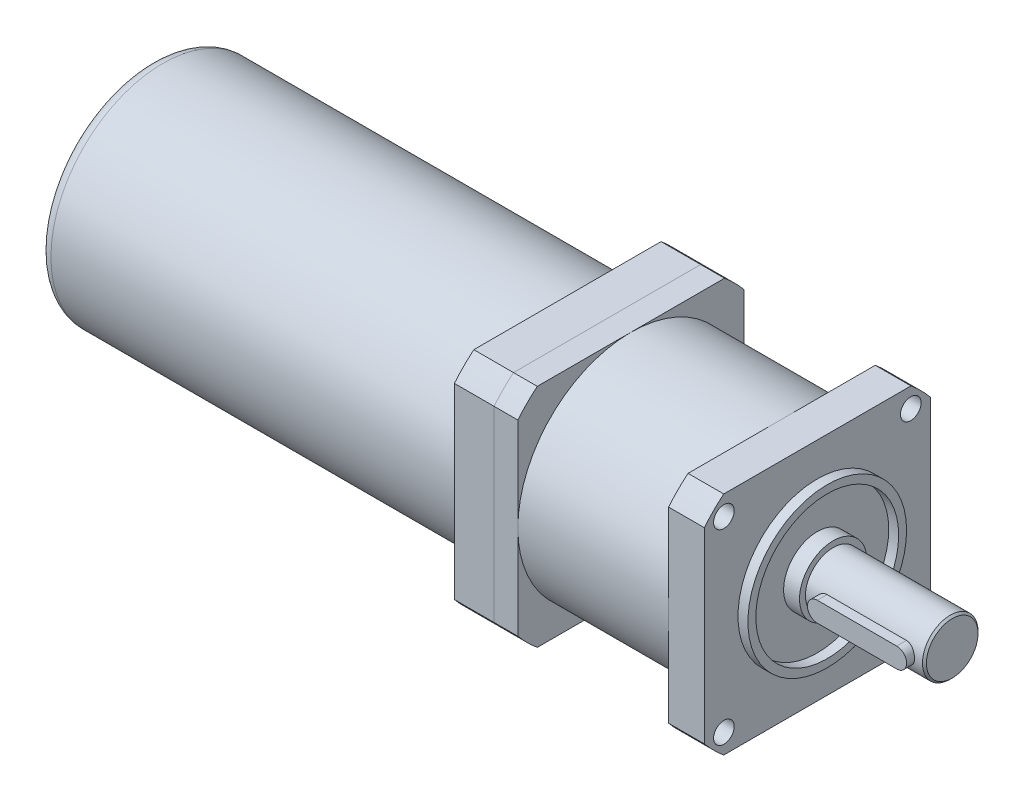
ISO-10303-21;
HEADER;
FILE_DESCRIPTION(('STEP AP214'),'2;1');
FILE_NAME('part.step','',(''),(''),'','','');
FILE_SCHEMA(('AUTOMOTIVE_DESIGN { 1 0 10303 214 1 1 1 1 }'));
ENDSEC;
DATA;
#1=APPLICATION_CONTEXT('core data for automotive mechanical design processes');
#2=APPLICATION_PROTOCOL_DEFINITION('international standard','automotive_design',2000,#1);
#3=PRODUCT_CONTEXT('',#1,'mechanical');
#4=PRODUCT('Part','Part','',(#3));
#5=PRODUCT_RELATED_PRODUCT_CATEGORY('part','',(#4));
#6=PRODUCT_DEFINITION_FORMATION('','',#4);
#7=PRODUCT_DEFINITION_CONTEXT('part definition',#1,'design');
#8=PRODUCT_DEFINITION('design','',#6,#7);
#9=PRODUCT_DEFINITION_SHAPE('','',#8);
#10=(LENGTH_UNIT() NAMED_UNIT(*) SI_UNIT(.MILLI.,.METRE.));
#11=(NAMED_UNIT(*) PLANE_ANGLE_UNIT() SI_UNIT($,.RADIAN.));
#12=(NAMED_UNIT(*) SI_UNIT($,.STERADIAN.) SOLID_ANGLE_UNIT());
#13=UNCERTAINTY_MEASURE_WITH_UNIT(LENGTH_MEASURE(1.E-05),#10,'distance_accuracy_value','');
#14=(GEOMETRIC_REPRESENTATION_CONTEXT(3) GLOBAL_UNCERTAINTY_ASSIGNED_CONTEXT((#13)) GLOBAL_UNIT_ASSIGNED_CONTEXT((#10,
#11,#12)) REPRESENTATION_CONTEXT('',''));
#15=CARTESIAN_POINT('',(0.,0.,0.));
#16=DIRECTION('',(0.,0.,1.));
#17=DIRECTION('',(1.,0.,0.));
#18=AXIS2_PLACEMENT_3D('',#15,#16,#17);
#19=CARTESIAN_POINT('',(-63.,0.,0.));
#20=DIRECTION('',(-1.,0.,0.));
#21=DIRECTION('',(0.,0.,1.));
#22=AXIS2_PLACEMENT_3D('',#19,#20,#21);
#23=PLANE('',#22);
#24=CARTESIAN_POINT('',(-63.,0.,0.));
#25=DIRECTION('',(-1.,0.,0.));
#26=DIRECTION('',(0.,0.,1.));
#27=AXIS2_PLACEMENT_3D('',#24,#25,#26);
#28=CIRCLE('',#27,37.);
#29=CARTESIAN_POINT('',(-63.,28.5,-23.5955504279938));
#30=VERTEX_POINT('',#29);
#31=CARTESIAN_POINT('',(-63.,23.5955504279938,-28.5));
#32=VERTEX_POINT('',#31);
#33=EDGE_CURVE('E158',#30,#32,#28,.T.);
#34=ORIENTED_EDGE('',*,*,#33,.T.);
#35=DIRECTION('',(0.,-1.,0.));
#36=VECTOR('',#35,1.);
#37=CARTESIAN_POINT('',(-63.,-23.5955504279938,-28.5));
#38=LINE('',#37,#36);
#39=CARTESIAN_POINT('',(-63.,-23.5955504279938,-28.5));
#40=VERTEX_POINT('',#39);
#41=EDGE_CURVE('E106',#32,#40,#38,.T.);
#42=ORIENTED_EDGE('',*,*,#41,.T.);
#43=CARTESIAN_POINT('',(-63.,0.,0.));
#44=DIRECTION('',(-1.,0.,0.));
#45=DIRECTION('',(0.,0.,1.));
#46=AXIS2_PLACEMENT_3D('',#43,#44,#45);
#47=CIRCLE('',#46,37.);
#48=CARTESIAN_POINT('',(-63.,-28.5,-23.5955504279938));
#49=VERTEX_POINT('',#48);
#50=EDGE_CURVE('E226',#40,#49,#47,.T.);
#51=ORIENTED_EDGE('',*,*,#50,.T.);
#52=DIRECTION('',(0.,0.,1.));
#53=VECTOR('',#52,1.);
#54=CARTESIAN_POINT('',(-63.,-28.5,-23.5955504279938));
#55=LINE('',#54,#53);
#56=CARTESIAN_POINT('',(-63.,-28.5,23.5955504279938));
#57=VERTEX_POINT('',#56);
#58=EDGE_CURVE('E231',#49,#57,#55,.T.);
#59=ORIENTED_EDGE('',*,*,#58,.T.);
#60=CARTESIAN_POINT('',(-63.,0.,0.));
#61=DIRECTION('',(-1.,0.,0.));
#62=DIRECTION('',(0.,0.,1.));
#63=AXIS2_PLACEMENT_3D('',#60,#61,#62);
#64=CIRCLE('',#63,37.);
#65=CARTESIAN_POINT('',(-63.,-23.5955504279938,28.5));
#66=VERTEX_POINT('',#65);
#67=EDGE_CURVE('E125',#57,#66,#64,.T.);
#68=ORIENTED_EDGE('',*,*,#67,.T.);
#69=DIRECTION('',(0.,1.,0.));
#70=VECTOR('',#69,1.);
#71=CARTESIAN_POINT('',(-63.,-23.5955504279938,28.5));
#72=LINE('',#71,#70);
#73=CARTESIAN_POINT('',(-63.,23.5955504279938,28.5));
#74=VERTEX_POINT('',#73);
#75=EDGE_CURVE('E119',#66,#74,#72,.T.);
#76=ORIENTED_EDGE('',*,*,#75,.T.);
#77=CARTESIAN_POINT('',(-63.,0.,0.));
#78=DIRECTION('',(-1.,0.,0.));
#79=DIRECTION('',(0.,0.,1.));
#80=AXIS2_PLACEMENT_3D('',#77,#78,#79);
#81=CIRCLE('',#80,37.);
#82=CARTESIAN_POINT('',(-63.,28.5,23.5955504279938));
#83=VERTEX_POINT('',#82);
#84=EDGE_CURVE('E123',#74,#83,#81,.T.);
#85=ORIENTED_EDGE('',*,*,#84,.T.);
#86=DIRECTION('',(0.,0.,-1.));
#87=VECTOR('',#86,1.);
#88=CARTESIAN_POINT('',(-63.,28.5,-23.5955504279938));
#89=LINE('',#88,#87);
#90=EDGE_CURVE('E62',#83,#30,#89,.T.);
#91=ORIENTED_EDGE('',*,*,#90,.T.);
#92=EDGE_LOOP('',(#34,#42,#51,#59,#68,#76,#85,#91));
#93=FACE_BOUND('',#92,.T.);
#94=CARTESIAN_POINT('',(-63.,0.,0.));
#95=DIRECTION('',(-1.,0.,0.));
#96=DIRECTION('',(0.,0.,1.));
#97=AXIS2_PLACEMENT_3D('',#94,#95,#96);
#98=CIRCLE('',#97,28.2);
#99=CARTESIAN_POINT('',(-63.,0.,28.2));
#100=VERTEX_POINT('',#99);
#101=EDGE_CURVE('E147',#100,#100,#98,.T.);
#102=ORIENTED_EDGE('',*,*,#101,.F.);
#103=EDGE_LOOP('',(#102));
#104=FACE_BOUND('',#103,.T.);
#105=ADVANCED_FACE('F45',(#93,#104),#23,.T.);
#106=CARTESIAN_POINT('',(-63.,0.,0.));
#107=DIRECTION('',(1.,0.,0.));
#108=DIRECTION('',(0.,0.,-1.));
#109=AXIS2_PLACEMENT_3D('',#106,#107,#108);
#110=CYLINDRICAL_SURFACE('',#109,37.);
#111=CARTESIAN_POINT('',(-53.,0.,0.));
#112=DIRECTION('',(-1.,0.,0.));
#113=DIRECTION('',(0.,0.,1.));
#114=AXIS2_PLACEMENT_3D('',#111,#112,#113);
#115=CIRCLE('',#114,37.);
#116=CARTESIAN_POINT('',(-53.,28.5,-23.5955504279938));
#117=VERTEX_POINT('',#116);
#118=CARTESIAN_POINT('',(-53.,23.5955504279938,-28.5));
#119=VERTEX_POINT('',#118);
#120=EDGE_CURVE('E143',#117,#119,#115,.T.);
#121=ORIENTED_EDGE('',*,*,#120,.T.);
#122=DIRECTION('',(1.,0.,0.));
#123=VECTOR('',#122,1.);
#124=CARTESIAN_POINT('',(-63.,23.5955504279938,-28.5));
#125=LINE('',#124,#123);
#126=EDGE_CURVE('E171',#32,#119,#125,.T.);
#127=ORIENTED_EDGE('',*,*,#126,.F.);
#128=ORIENTED_EDGE('',*,*,#33,.F.);
#129=DIRECTION('',(1.,0.,0.));
#130=VECTOR('',#129,1.);
#131=CARTESIAN_POINT('',(-63.,28.5,-23.5955504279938));
#132=LINE('',#131,#130);
#133=EDGE_CURVE('E139',#30,#117,#132,.T.);
#134=ORIENTED_EDGE('',*,*,#133,.T.);
#135=EDGE_LOOP('',(#121,#127,#128,#134));
#136=FACE_BOUND('',#135,.T.);
#137=ADVANCED_FACE('F186',(#136),#110,.T.);
#138=CARTESIAN_POINT('',(-63.,-23.5955504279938,-28.5));
#139=DIRECTION('',(0.,0.,1.));
#140=DIRECTION('',(1.,0.,0.));
#141=AXIS2_PLACEMENT_3D('',#138,#139,#140);
#142=PLANE('',#141);
#143=DIRECTION('',(0.,-1.,0.));
#144=VECTOR('',#143,1.);
#145=CARTESIAN_POINT('',(-53.,-23.5955504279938,-28.5));
#146=LINE('',#145,#144);
#147=CARTESIAN_POINT('',(-53.,-23.5955504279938,-28.5));
#148=VERTEX_POINT('',#147);
#149=EDGE_CURVE('E146',#119,#148,#146,.T.);
#150=ORIENTED_EDGE('',*,*,#149,.T.);
#151=DIRECTION('',(1.,0.,0.));
#152=VECTOR('',#151,1.);
#153=CARTESIAN_POINT('',(-63.,-23.5955504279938,-28.5));
#154=LINE('',#153,#152);
#155=EDGE_CURVE('E168',#40,#148,#154,.T.);
#156=ORIENTED_EDGE('',*,*,#155,.F.);
#157=ORIENTED_EDGE('',*,*,#41,.F.);
#158=ORIENTED_EDGE('',*,*,#126,.T.);
#159=EDGE_LOOP('',(#150,#156,#157,#158));
#160=FACE_BOUND('',#159,.T.);
#161=ADVANCED_FACE('F191',(#160),#142,.F.);
#162=CARTESIAN_POINT('',(-63.,0.,0.));
#163=DIRECTION('',(1.,0.,0.));
#164=DIRECTION('',(0.,0.,-1.));
#165=AXIS2_PLACEMENT_3D('',#162,#163,#164);
#166=CYLINDRICAL_SURFACE('',#165,37.);
#167=CARTESIAN_POINT('',(-53.,0.,0.));
#168=DIRECTION('',(-1.,0.,0.));
#169=DIRECTION('',(0.,0.,1.));
#170=AXIS2_PLACEMENT_3D('',#167,#168,#169);
#171=CIRCLE('',#170,37.);
#172=CARTESIAN_POINT('',(-53.,-28.5,-23.5955504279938));
#173=VERTEX_POINT('',#172);
#174=EDGE_CURVE('E149',#148,#173,#171,.T.);
#175=ORIENTED_EDGE('',*,*,#174,.T.);
#176=DIRECTION('',(1.,0.,0.));
#177=VECTOR('',#176,1.);
#178=CARTESIAN_POINT('',(-63.,-28.5,-23.5955504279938));
#179=LINE('',#178,#177);
#180=EDGE_CURVE('E165',#49,#173,#179,.T.);
#181=ORIENTED_EDGE('',*,*,#180,.F.);
#182=ORIENTED_EDGE('',*,*,#50,.F.);
#183=ORIENTED_EDGE('',*,*,#155,.T.);
#184=EDGE_LOOP('',(#175,#181,#182,#183));
#185=FACE_BOUND('',#184,.T.);
#186=ADVANCED_FACE('F213',(#185),#166,.T.);
#187=CARTESIAN_POINT('',(-63.,-28.5,-23.5955504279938));
#188=DIRECTION('',(0.,1.,0.));
#189=DIRECTION('',(0.,0.,1.));
#190=AXIS2_PLACEMENT_3D('',#187,#188,#189);
#191=PLANE('',#190);
#192=DIRECTION('',(0.,0.,1.));
#193=VECTOR('',#192,1.);
#194=CARTESIAN_POINT('',(-53.,-28.5,-23.5955504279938));
#195=LINE('',#194,#193);
#196=CARTESIAN_POINT('',(-53.,-28.5,23.5955504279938));
#197=VERTEX_POINT('',#196);
#198=EDGE_CURVE('E151',#173,#197,#195,.T.);
#199=ORIENTED_EDGE('',*,*,#198,.T.);
#200=DIRECTION('',(1.,0.,0.));
#201=VECTOR('',#200,1.);
#202=CARTESIAN_POINT('',(-63.,-28.5,23.5955504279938));
#203=LINE('',#202,#201);
#204=EDGE_CURVE('E162',#57,#197,#203,.T.);
#205=ORIENTED_EDGE('',*,*,#204,.F.);
#206=ORIENTED_EDGE('',*,*,#58,.F.);
#207=ORIENTED_EDGE('',*,*,#180,.T.);
#208=EDGE_LOOP('',(#199,#205,#206,#207));
#209=FACE_BOUND('',#208,.T.);
#210=ADVANCED_FACE('F209',(#209),#191,.F.);
#211=CARTESIAN_POINT('',(-63.,0.,0.));
#212=DIRECTION('',(1.,0.,0.));
#213=DIRECTION('',(0.,0.,-1.));
#214=AXIS2_PLACEMENT_3D('',#211,#212,#213);
#215=CYLINDRICAL_SURFACE('',#214,37.);
#216=CARTESIAN_POINT('',(-53.,0.,0.));
#217=DIRECTION('',(-1.,0.,0.));
#218=DIRECTION('',(0.,0.,1.));
#219=AXIS2_PLACEMENT_3D('',#216,#217,#218);
#220=CIRCLE('',#219,37.);
#221=CARTESIAN_POINT('',(-53.,-23.5955504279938,28.5));
#222=VERTEX_POINT('',#221);
#223=EDGE_CURVE('E153',#197,#222,#220,.T.);
#224=ORIENTED_EDGE('',*,*,#223,.T.);
#225=DIRECTION('',(1.,0.,0.));
#226=VECTOR('',#225,1.);
#227=CARTESIAN_POINT('',(-63.,-23.5955504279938,28.5));
#228=LINE('',#227,#226);
#229=EDGE_CURVE('E134',#66,#222,#228,.T.);
#230=ORIENTED_EDGE('',*,*,#229,.F.);
#231=ORIENTED_EDGE('',*,*,#67,.F.);
#232=ORIENTED_EDGE('',*,*,#204,.T.);
#233=EDGE_LOOP('',(#224,#230,#231,#232));
#234=FACE_BOUND('',#233,.T.);
#235=ADVANCED_FACE('F206',(#234),#215,.T.);
#236=CARTESIAN_POINT('',(-63.,-23.5955504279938,28.5));
#237=DIRECTION('',(0.,0.,-1.));
#238=DIRECTION('',(-1.,0.,0.));
#239=AXIS2_PLACEMENT_3D('',#236,#237,#238);
#240=PLANE('',#239);
#241=DIRECTION('',(0.,1.,0.));
#242=VECTOR('',#241,1.);
#243=CARTESIAN_POINT('',(-53.,-23.5955504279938,28.5));
#244=LINE('',#243,#242);
#245=CARTESIAN_POINT('',(-53.,23.5955504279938,28.5));
#246=VERTEX_POINT('',#245);
#247=EDGE_CURVE('E133',#222,#246,#244,.T.);
#248=ORIENTED_EDGE('',*,*,#247,.T.);
#249=DIRECTION('',(1.,0.,0.));
#250=VECTOR('',#249,1.);
#251=CARTESIAN_POINT('',(-63.,23.5955504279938,28.5));
#252=LINE('',#251,#250);
#253=EDGE_CURVE('E130',#74,#246,#252,.T.);
#254=ORIENTED_EDGE('',*,*,#253,.F.);
#255=ORIENTED_EDGE('',*,*,#75,.F.);
#256=ORIENTED_EDGE('',*,*,#229,.T.);
#257=EDGE_LOOP('',(#248,#254,#255,#256));
#258=FACE_BOUND('',#257,.T.);
#259=ADVANCED_FACE('F131',(#258),#240,.F.);
#260=CARTESIAN_POINT('',(-63.,0.,0.));
#261=DIRECTION('',(1.,0.,0.));
#262=DIRECTION('',(0.,0.,-1.));
#263=AXIS2_PLACEMENT_3D('',#260,#261,#262);
#264=CYLINDRICAL_SURFACE('',#263,37.);
#265=CARTESIAN_POINT('',(-53.,0.,0.));
#266=DIRECTION('',(-1.,0.,0.));
#267=DIRECTION('',(0.,0.,1.));
#268=AXIS2_PLACEMENT_3D('',#265,#266,#267);
#269=CIRCLE('',#268,37.);
#270=CARTESIAN_POINT('',(-53.,28.5,23.5955504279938));
#271=VERTEX_POINT('',#270);
#272=EDGE_CURVE('E91',#246,#271,#269,.T.);
#273=ORIENTED_EDGE('',*,*,#272,.T.);
#274=DIRECTION('',(1.,0.,0.));
#275=VECTOR('',#274,1.);
#276=CARTESIAN_POINT('',(-63.,28.5,23.5955504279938));
#277=LINE('',#276,#275);
#278=EDGE_CURVE('E135',#83,#271,#277,.T.);
#279=ORIENTED_EDGE('',*,*,#278,.F.);
#280=ORIENTED_EDGE('',*,*,#84,.F.);
#281=ORIENTED_EDGE('',*,*,#253,.T.);
#282=EDGE_LOOP('',(#273,#279,#280,#281));
#283=FACE_BOUND('',#282,.T.);
#284=ADVANCED_FACE('F137',(#283),#264,.T.);
#285=CARTESIAN_POINT('',(-63.,28.5,-23.5955504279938));
#286=DIRECTION('',(0.,-1.,0.));
#287=DIRECTION('',(0.,0.,-1.));
#288=AXIS2_PLACEMENT_3D('',#285,#286,#287);
#289=PLANE('',#288);
#290=DIRECTION('',(0.,0.,-1.));
#291=VECTOR('',#290,1.);
#292=CARTESIAN_POINT('',(-53.,28.5,-23.5955504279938));
#293=LINE('',#292,#291);
#294=EDGE_CURVE('E97',#271,#117,#293,.T.);
#295=ORIENTED_EDGE('',*,*,#294,.T.);
#296=ORIENTED_EDGE('',*,*,#133,.F.);
#297=ORIENTED_EDGE('',*,*,#90,.F.);
#298=ORIENTED_EDGE('',*,*,#278,.T.);
#299=EDGE_LOOP('',(#295,#296,#297,#298));
#300=FACE_BOUND('',#299,.T.);
#301=ADVANCED_FACE('F198',(#300),#289,.F.);
#302=CARTESIAN_POINT('',(-53.,0.,0.));
#303=DIRECTION('',(-1.,0.,0.));
#304=DIRECTION('',(0.,0.,1.));
#305=AXIS2_PLACEMENT_3D('',#302,#303,#304);
#306=PLANE('',#305);
#307=ORIENTED_EDGE('',*,*,#120,.F.);
#308=ORIENTED_EDGE('',*,*,#294,.F.);
#309=ORIENTED_EDGE('',*,*,#272,.F.);
#310=ORIENTED_EDGE('',*,*,#247,.F.);
#311=ORIENTED_EDGE('',*,*,#223,.F.);
#312=ORIENTED_EDGE('',*,*,#198,.F.);
#313=ORIENTED_EDGE('',*,*,#174,.F.);
#314=ORIENTED_EDGE('',*,*,#149,.F.);
#315=EDGE_LOOP('',(#307,#308,#309,#310,#311,#312,#313,#314));
#316=FACE_BOUND('',#315,.T.);
#317=ADVANCED_FACE('F195',(#316),#306,.F.);
#318=CARTESIAN_POINT('',(-168.,0.,0.));
#319=DIRECTION('',(1.,0.,0.));
#320=DIRECTION('',(0.,0.,-1.));
#321=AXIS2_PLACEMENT_3D('',#318,#319,#320);
#322=CYLINDRICAL_SURFACE('',#321,28.2);
#323=CARTESIAN_POINT('',(-165.,0.,0.));
#324=DIRECTION('',(-1.,0.,0.));
#325=DIRECTION('',(0.,0.,1.));
#326=AXIS2_PLACEMENT_3D('',#323,#324,#325);
#327=CIRCLE('',#326,28.2);
#328=CARTESIAN_POINT('',(-165.,0.,28.2));
#329=VERTEX_POINT('',#328);
#330=EDGE_CURVE('E12',#329,#329,#327,.F.);
#331=ORIENTED_EDGE('',*,*,#330,.T.);
#332=EDGE_LOOP('',(#331));
#333=FACE_BOUND('',#332,.T.);
#334=ORIENTED_EDGE('',*,*,#101,.T.);
#335=EDGE_LOOP('',(#334));
#336=FACE_BOUND('',#335,.T.);
#337=ADVANCED_FACE('F182',(#333,#336),#322,.T.);
#338=CARTESIAN_POINT('',(-168.,0.,0.));
#339=DIRECTION('',(-1.,0.,0.));
#340=DIRECTION('',(0.,0.,1.));
#341=AXIS2_PLACEMENT_3D('',#338,#339,#340);
#342=PLANE('',#341);
#343=CARTESIAN_POINT('',(-168.,0.,0.));
#344=DIRECTION('',(-1.,0.,0.));
#345=DIRECTION('',(0.,0.,1.));
#346=AXIS2_PLACEMENT_3D('',#343,#344,#345);
#347=CIRCLE('',#346,25.2);
#348=CARTESIAN_POINT('',(-168.,0.,25.2));
#349=VERTEX_POINT('',#348);
#350=EDGE_CURVE('E54',#349,#349,#347,.T.);
#351=ORIENTED_EDGE('',*,*,#350,.T.);
#352=EDGE_LOOP('',(#351));
#353=FACE_BOUND('',#352,.T.);
#354=ADVANCED_FACE('F175',(#353),#342,.T.);
#355=CARTESIAN_POINT('',(-165.,0.,0.));
#356=DIRECTION('',(-1.,0.,0.));
#357=DIRECTION('',(0.,0.,1.));
#358=AXIS2_PLACEMENT_3D('',#355,#356,#357);
#359=TOROIDAL_SURFACE('',#358,25.2,3.);
#360=ORIENTED_EDGE('',*,*,#330,.F.);
#361=EDGE_LOOP('',(#360));
#362=FACE_BOUND('',#361,.T.);
#363=ORIENTED_EDGE('',*,*,#350,.F.);
#364=EDGE_LOOP('',(#363));
#365=FACE_BOUND('',#364,.T.);
#366=ADVANCED_FACE('F47',(#362,#365),#359,.T.);
#367=CLOSED_SHELL('',(#105,#137,#161,#186,#210,#235,#259,#284,#301,#317,#337,#354,#366));
#368=MANIFOLD_SOLID_BREP('B2',#367);
#369=CARTESIAN_POINT('',(4.,0.,0.));
#370=DIRECTION('',(1.,0.,0.));
#371=DIRECTION('',(0.,0.,-1.));
#372=AXIS2_PLACEMENT_3D('',#369,#370,#371);
#373=PLANE('',#372);
#374=CARTESIAN_POINT('',(4.,0.,0.));
#375=DIRECTION('',(1.,0.,0.));
#376=DIRECTION('',(0.,0.,-1.));
#377=AXIS2_PLACEMENT_3D('',#374,#375,#376);
#378=CIRCLE('',#377,8.5);
#379=CARTESIAN_POINT('',(4.,0.,-8.5));
#380=VERTEX_POINT('',#379);
#381=EDGE_CURVE('E510',#380,#380,#378,.T.);
#382=ORIENTED_EDGE('',*,*,#381,.T.);
#383=EDGE_LOOP('',(#382));
#384=FACE_BOUND('',#383,.T.);
#385=CARTESIAN_POINT('',(4.,0.,0.));
#386=DIRECTION('',(1.,0.,0.));
#387=DIRECTION('',(0.,0.,-1.));
#388=AXIS2_PLACEMENT_3D('',#385,#386,#387);
#389=CIRCLE('',#388,7.);
#390=CARTESIAN_POINT('',(4.,0.,-7.));
#391=VERTEX_POINT('',#390);
#392=EDGE_CURVE('E501',#391,#391,#389,.T.);
#393=ORIENTED_EDGE('',*,*,#392,.F.);
#394=EDGE_LOOP('',(#393));
#395=FACE_BOUND('',#394,.T.);
#396=ADVANCED_FACE('F318',(#384,#395),#373,.T.);
#397=CARTESIAN_POINT('',(0.,0.,0.));
#398=DIRECTION('',(1.,0.,0.));
#399=DIRECTION('',(0.,0.,-1.));
#400=AXIS2_PLACEMENT_3D('',#397,#398,#399);
#401=PLANE('',#400);
#402=CARTESIAN_POINT('',(0.,0.,0.));
#403=DIRECTION('',(1.,0.,0.));
#404=DIRECTION('',(0.,0.,-1.));
#405=AXIS2_PLACEMENT_3D('',#402,#403,#404);
#406=CIRCLE('',#405,18.);
#407=CARTESIAN_POINT('',(0.,0.,-18.));
#408=VERTEX_POINT('',#407);
#409=EDGE_CURVE('E690',#408,#408,#406,.F.);
#410=ORIENTED_EDGE('',*,*,#409,.F.);
#411=EDGE_LOOP('',(#410));
#412=FACE_BOUND('',#411,.T.);
#413=CARTESIAN_POINT('',(0.,0.,0.));
#414=DIRECTION('',(1.,0.,0.));
#415=DIRECTION('',(0.,0.,-1.));
#416=AXIS2_PLACEMENT_3D('',#413,#414,#415);
#417=CIRCLE('',#416,8.5);
#418=CARTESIAN_POINT('',(0.,0.,-8.5));
#419=VERTEX_POINT('',#418);
#420=EDGE_CURVE('E504',#419,#419,#417,.T.);
#421=ORIENTED_EDGE('',*,*,#420,.F.);
#422=EDGE_LOOP('',(#421));
#423=FACE_BOUND('',#422,.T.);
#424=ADVANCED_FACE('F725',(#412,#423),#401,.T.);
#425=CARTESIAN_POINT('',(0.,-23.55,23.55));
#426=DIRECTION('',(1.,0.,0.));
#427=DIRECTION('',(0.,0.,-1.));
#428=AXIS2_PLACEMENT_3D('',#425,#426,#427);
#429=CIRCLE('',#428,2.6);
#430=CARTESIAN_POINT('',(0.,-23.55,20.95));
#431=VERTEX_POINT('',#430);
#432=EDGE_CURVE('E522',#431,#431,#429,.T.);
#433=ORIENTED_EDGE('',*,*,#432,.F.);
#434=EDGE_LOOP('',(#433));
#435=FACE_BOUND('',#434,.T.);
#436=CARTESIAN_POINT('',(0.,-23.55,-23.55));
#437=DIRECTION('',(1.,0.,0.));
#438=DIRECTION('',(0.,0.,-1.));
#439=AXIS2_PLACEMENT_3D('',#436,#437,#438);
#440=CIRCLE('',#439,2.6);
#441=CARTESIAN_POINT('',(0.,-23.55,-26.15));
#442=VERTEX_POINT('',#441);
#443=EDGE_CURVE('E528',#442,#442,#440,.T.);
#444=ORIENTED_EDGE('',*,*,#443,.F.);
#445=EDGE_LOOP('',(#444));
#446=FACE_BOUND('',#445,.T.);
#447=CARTESIAN_POINT('',(0.,23.55,-23.55));
#448=DIRECTION('',(1.,0.,0.));
#449=DIRECTION('',(0.,0.,-1.));
#450=AXIS2_PLACEMENT_3D('',#447,#448,#449);
#451=CIRCLE('',#450,2.6);
#452=CARTESIAN_POINT('',(0.,23.55,-26.15));
#453=VERTEX_POINT('',#452);
#454=EDGE_CURVE('E534',#453,#453,#451,.T.);
#455=ORIENTED_EDGE('',*,*,#454,.F.);
#456=EDGE_LOOP('',(#455));
#457=FACE_BOUND('',#456,.T.);
#458=CARTESIAN_POINT('',(0.,23.55,23.55));
#459=DIRECTION('',(1.,0.,0.));
#460=DIRECTION('',(0.,0.,-1.));
#461=AXIS2_PLACEMENT_3D('',#458,#459,#460);
#462=CIRCLE('',#461,2.6);
#463=CARTESIAN_POINT('',(0.,23.55,20.95));
#464=VERTEX_POINT('',#463);
#465=EDGE_CURVE('E540',#464,#464,#462,.T.);
#466=ORIENTED_EDGE('',*,*,#465,.F.);
#467=EDGE_LOOP('',(#466));
#468=FACE_BOUND('',#467,.T.);
#469=CARTESIAN_POINT('',(0.,0.,0.));
#470=DIRECTION('',(1.,0.,0.));
#471=DIRECTION('',(0.,0.,-1.));
#472=AXIS2_PLACEMENT_3D('',#469,#470,#471);
#473=CIRCLE('',#472,37.);
#474=CARTESIAN_POINT('',(0.,23.5955504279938,-28.5));
#475=VERTEX_POINT('',#474);
#476=CARTESIAN_POINT('',(0.,28.5,-23.5955504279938));
#477=VERTEX_POINT('',#476);
#478=EDGE_CURVE('E618',#475,#477,#473,.T.);
#479=ORIENTED_EDGE('',*,*,#478,.T.);
#480=DIRECTION('',(0.,0.,1.));
#481=VECTOR('',#480,1.);
#482=CARTESIAN_POINT('',(0.,28.5,23.5955504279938));
#483=LINE('',#482,#481);
#484=CARTESIAN_POINT('',(0.,28.5,23.5955504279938));
#485=VERTEX_POINT('',#484);
#486=EDGE_CURVE('E655',#477,#485,#483,.T.);
#487=ORIENTED_EDGE('',*,*,#486,.T.);
#488=CARTESIAN_POINT('',(0.,0.,0.));
#489=DIRECTION('',(1.,0.,0.));
#490=DIRECTION('',(0.,0.,-1.));
#491=AXIS2_PLACEMENT_3D('',#488,#489,#490);
#492=CIRCLE('',#491,37.);
#493=CARTESIAN_POINT('',(0.,23.5955504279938,28.5));
#494=VERTEX_POINT('',#493);
#495=EDGE_CURVE('E658',#485,#494,#492,.T.);
#496=ORIENTED_EDGE('',*,*,#495,.T.);
#497=DIRECTION('',(0.,-1.,0.));
#498=VECTOR('',#497,1.);
#499=CARTESIAN_POINT('',(0.,-23.5955504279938,28.5));
#500=LINE('',#499,#498);
#501=CARTESIAN_POINT('',(0.,-23.5955504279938,28.5));
#502=VERTEX_POINT('',#501);
#503=EDGE_CURVE('E661',#494,#502,#500,.T.);
#504=ORIENTED_EDGE('',*,*,#503,.T.);
#505=CARTESIAN_POINT('',(0.,0.,0.));
#506=DIRECTION('',(1.,0.,0.));
#507=DIRECTION('',(0.,0.,-1.));
#508=AXIS2_PLACEMENT_3D('',#505,#506,#507);
#509=CIRCLE('',#508,37.);
#510=CARTESIAN_POINT('',(0.,-28.5,23.5955504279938));
#511=VERTEX_POINT('',#510);
#512=EDGE_CURVE('E664',#502,#511,#509,.T.);
#513=ORIENTED_EDGE('',*,*,#512,.T.);
#514=DIRECTION('',(0.,0.,-1.));
#515=VECTOR('',#514,1.);
#516=CARTESIAN_POINT('',(0.,-28.5,23.5955504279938));
#517=LINE('',#516,#515);
#518=CARTESIAN_POINT('',(0.,-28.5,-23.5955504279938));
#519=VERTEX_POINT('',#518);
#520=EDGE_CURVE('E667',#511,#519,#517,.T.);
#521=ORIENTED_EDGE('',*,*,#520,.T.);
#522=CARTESIAN_POINT('',(0.,0.,0.));
#523=DIRECTION('',(1.,0.,0.));
#524=DIRECTION('',(0.,0.,-1.));
#525=AXIS2_PLACEMENT_3D('',#522,#523,#524);
#526=CIRCLE('',#525,37.);
#527=CARTESIAN_POINT('',(0.,-23.5955504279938,-28.5));
#528=VERTEX_POINT('',#527);
#529=EDGE_CURVE('E670',#519,#528,#526,.T.);
#530=ORIENTED_EDGE('',*,*,#529,.T.);
#531=DIRECTION('',(0.,1.,0.));
#532=VECTOR('',#531,1.);
#533=CARTESIAN_POINT('',(0.,-23.5955504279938,-28.5));
#534=LINE('',#533,#532);
#535=EDGE_CURVE('E628',#528,#475,#534,.T.);
#536=ORIENTED_EDGE('',*,*,#535,.T.);
#537=EDGE_LOOP('',(#479,#487,#496,#504,#513,#521,#530,#536));
#538=FACE_BOUND('',#537,.T.);
#539=CARTESIAN_POINT('',(0.,0.,0.));
#540=DIRECTION('',(1.,0.,0.));
#541=DIRECTION('',(0.,0.,-1.));
#542=AXIS2_PLACEMENT_3D('',#539,#540,#541);
#543=CIRCLE('',#542,20.);
#544=CARTESIAN_POINT('',(0.,0.,-20.));
#545=VERTEX_POINT('',#544);
#546=EDGE_CURVE('E518',#545,#545,#543,.T.);
#547=ORIENTED_EDGE('',*,*,#546,.F.);
#548=EDGE_LOOP('',(#547));
#549=FACE_BOUND('',#548,.T.);
#550=ADVANCED_FACE('F730',(#435,#446,#457,#468,#538,#549),#401,.T.);
#551=CARTESIAN_POINT('',(-9.,0.,0.));
#552=DIRECTION('',(1.,0.,0.));
#553=DIRECTION('',(0.,0.,-1.));
#554=AXIS2_PLACEMENT_3D('',#551,#552,#553);
#555=PLANE('',#554);
#556=CARTESIAN_POINT('',(-9.,23.55,23.55));
#557=DIRECTION('',(1.,0.,0.));
#558=DIRECTION('',(0.,0.,-1.));
#559=AXIS2_PLACEMENT_3D('',#556,#557,#558);
#560=CIRCLE('',#559,2.6);
#561=CARTESIAN_POINT('',(-9.,23.55,20.95));
#562=VERTEX_POINT('',#561);
#563=EDGE_CURVE('E543',#562,#562,#560,.T.);
#564=ORIENTED_EDGE('',*,*,#563,.T.);
#565=EDGE_LOOP('',(#564));
#566=FACE_BOUND('',#565,.T.);
#567=CARTESIAN_POINT('',(-9.,0.,0.));
#568=DIRECTION('',(-1.,0.,0.));
#569=DIRECTION('',(0.,0.,1.));
#570=AXIS2_PLACEMENT_3D('',#567,#568,#569);
#571=CIRCLE('',#570,28.5);
#572=CARTESIAN_POINT('',(-9.,0.,28.5));
#573=VERTEX_POINT('',#572);
#574=CARTESIAN_POINT('',(-9.,28.5,0.));
#575=VERTEX_POINT('',#574);
#576=EDGE_CURVE('E614',#573,#575,#571,.T.);
#577=ORIENTED_EDGE('',*,*,#576,.F.);
#578=DIRECTION('',(0.,-1.,0.));
#579=VECTOR('',#578,1.);
#580=CARTESIAN_POINT('',(-9.,-23.5955504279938,28.5));
#581=LINE('',#580,#579);
#582=CARTESIAN_POINT('',(-9.,23.5955504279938,28.5));
#583=VERTEX_POINT('',#582);
#584=EDGE_CURVE('E636',#583,#573,#581,.T.);
#585=ORIENTED_EDGE('',*,*,#584,.F.);
#586=CARTESIAN_POINT('',(-9.,0.,0.));
#587=DIRECTION('',(1.,0.,0.));
#588=DIRECTION('',(0.,0.,-1.));
#589=AXIS2_PLACEMENT_3D('',#586,#587,#588);
#590=CIRCLE('',#589,37.);
#591=CARTESIAN_POINT('',(-9.,28.5,23.5955504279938));
#592=VERTEX_POINT('',#591);
#593=EDGE_CURVE('E632',#592,#583,#590,.T.);
#594=ORIENTED_EDGE('',*,*,#593,.F.);
#595=DIRECTION('',(0.,0.,1.));
#596=VECTOR('',#595,1.);
#597=CARTESIAN_POINT('',(-9.,28.5,23.5955504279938));
#598=LINE('',#597,#596);
#599=EDGE_CURVE('E627',#575,#592,#598,.T.);
#600=ORIENTED_EDGE('',*,*,#599,.F.);
#601=EDGE_LOOP('',(#577,#585,#594,#600));
#602=FACE_BOUND('',#601,.T.);
#603=ADVANCED_FACE('F812',(#566,#602),#555,.F.);
#604=CARTESIAN_POINT('',(-9.,23.55,-23.55));
#605=DIRECTION('',(1.,0.,0.));
#606=DIRECTION('',(0.,0.,-1.));
#607=AXIS2_PLACEMENT_3D('',#604,#605,#606);
#608=CIRCLE('',#607,2.6);
#609=CARTESIAN_POINT('',(-9.,23.55,-26.15));
#610=VERTEX_POINT('',#609);
#611=EDGE_CURVE('E537',#610,#610,#608,.T.);
#612=ORIENTED_EDGE('',*,*,#611,.T.);
#613=EDGE_LOOP('',(#612));
#614=FACE_BOUND('',#613,.T.);
#615=CARTESIAN_POINT('',(-9.,0.,-28.5));
#616=VERTEX_POINT('',#615);
#617=EDGE_CURVE('E622',#575,#616,#571,.T.);
#618=ORIENTED_EDGE('',*,*,#617,.F.);
#619=CARTESIAN_POINT('',(-9.,28.5,-23.5955504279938));
#620=VERTEX_POINT('',#619);
#621=EDGE_CURVE('E629',#620,#575,#598,.T.);
#622=ORIENTED_EDGE('',*,*,#621,.F.);
#623=CARTESIAN_POINT('',(-9.,0.,0.));
#624=DIRECTION('',(1.,0.,0.));
#625=DIRECTION('',(0.,0.,-1.));
#626=AXIS2_PLACEMENT_3D('',#623,#624,#625);
#627=CIRCLE('',#626,37.);
#628=CARTESIAN_POINT('',(-9.,23.5955504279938,-28.5));
#629=VERTEX_POINT('',#628);
#630=EDGE_CURVE('E624',#629,#620,#627,.T.);
#631=ORIENTED_EDGE('',*,*,#630,.F.);
#632=DIRECTION('',(0.,1.,0.));
#633=VECTOR('',#632,1.);
#634=CARTESIAN_POINT('',(-9.,-23.5955504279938,-28.5));
#635=LINE('',#634,#633);
#636=EDGE_CURVE('E648',#616,#629,#635,.T.);
#637=ORIENTED_EDGE('',*,*,#636,.F.);
#638=EDGE_LOOP('',(#618,#622,#631,#637));
#639=FACE_BOUND('',#638,.T.);
#640=ADVANCED_FACE('F814',(#614,#639),#555,.F.);
#641=CARTESIAN_POINT('',(-9.,-23.55,-23.55));
#642=DIRECTION('',(1.,0.,0.));
#643=DIRECTION('',(0.,0.,-1.));
#644=AXIS2_PLACEMENT_3D('',#641,#642,#643);
#645=CIRCLE('',#644,2.6);
#646=CARTESIAN_POINT('',(-9.,-23.55,-26.15));
#647=VERTEX_POINT('',#646);
#648=EDGE_CURVE('E531',#647,#647,#645,.T.);
#649=ORIENTED_EDGE('',*,*,#648,.T.);
#650=EDGE_LOOP('',(#649));
#651=FACE_BOUND('',#650,.T.);
#652=CARTESIAN_POINT('',(-9.,-28.5,0.));
#653=VERTEX_POINT('',#652);
#654=EDGE_CURVE('E886',#616,#653,#571,.T.);
#655=ORIENTED_EDGE('',*,*,#654,.F.);
#656=CARTESIAN_POINT('',(-9.,-23.5955504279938,-28.5));
#657=VERTEX_POINT('',#656);
#658=EDGE_CURVE('E649',#657,#616,#635,.T.);
#659=ORIENTED_EDGE('',*,*,#658,.F.);
#660=CARTESIAN_POINT('',(-9.,0.,0.));
#661=DIRECTION('',(1.,0.,0.));
#662=DIRECTION('',(0.,0.,-1.));
#663=AXIS2_PLACEMENT_3D('',#660,#661,#662);
#664=CIRCLE('',#663,37.);
#665=CARTESIAN_POINT('',(-9.,-28.5,-23.5955504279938));
#666=VERTEX_POINT('',#665);
#667=EDGE_CURVE('E645',#666,#657,#664,.T.);
#668=ORIENTED_EDGE('',*,*,#667,.F.);
#669=DIRECTION('',(0.,0.,-1.));
#670=VECTOR('',#669,1.);
#671=CARTESIAN_POINT('',(-9.,-28.5,23.5955504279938));
#672=LINE('',#671,#670);
#673=EDGE_CURVE('E641',#653,#666,#672,.T.);
#674=ORIENTED_EDGE('',*,*,#673,.F.);
#675=EDGE_LOOP('',(#655,#659,#668,#674));
#676=FACE_BOUND('',#675,.T.);
#677=ADVANCED_FACE('F850',(#651,#676),#555,.F.);
#678=CARTESIAN_POINT('',(-9.,-23.55,23.55));
#679=DIRECTION('',(1.,0.,0.));
#680=DIRECTION('',(0.,0.,-1.));
#681=AXIS2_PLACEMENT_3D('',#678,#679,#680);
#682=CIRCLE('',#681,2.6);
#683=CARTESIAN_POINT('',(-9.,-23.55,20.95));
#684=VERTEX_POINT('',#683);
#685=EDGE_CURVE('E525',#684,#684,#682,.T.);
#686=ORIENTED_EDGE('',*,*,#685,.T.);
#687=EDGE_LOOP('',(#686));
#688=FACE_BOUND('',#687,.T.);
#689=EDGE_CURVE('E623',#653,#573,#571,.T.);
#690=ORIENTED_EDGE('',*,*,#689,.F.);
#691=CARTESIAN_POINT('',(-9.,-28.5,23.5955504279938));
#692=VERTEX_POINT('',#691);
#693=EDGE_CURVE('E642',#692,#653,#672,.T.);
#694=ORIENTED_EDGE('',*,*,#693,.F.);
#695=CARTESIAN_POINT('',(-9.,0.,0.));
#696=DIRECTION('',(1.,0.,0.));
#697=DIRECTION('',(0.,0.,-1.));
#698=AXIS2_PLACEMENT_3D('',#695,#696,#697);
#699=CIRCLE('',#698,37.);
#700=CARTESIAN_POINT('',(-9.,-23.5955504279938,28.5));
#701=VERTEX_POINT('',#700);
#702=EDGE_CURVE('E638',#701,#692,#699,.T.);
#703=ORIENTED_EDGE('',*,*,#702,.F.);
#704=EDGE_CURVE('E635',#573,#701,#581,.T.);
#705=ORIENTED_EDGE('',*,*,#704,.F.);
#706=EDGE_LOOP('',(#690,#694,#703,#705));
#707=FACE_BOUND('',#706,.T.);
#708=ADVANCED_FACE('F816',(#688,#707),#555,.F.);
#709=CARTESIAN_POINT('',(-9.,0.,0.));
#710=DIRECTION('',(1.,0.,0.));
#711=DIRECTION('',(0.,0.,-1.));
#712=AXIS2_PLACEMENT_3D('',#709,#710,#711);
#713=CYLINDRICAL_SURFACE('',#712,37.);
#714=ORIENTED_EDGE('',*,*,#478,.F.);
#715=DIRECTION('',(1.,0.,0.));
#716=VECTOR('',#715,1.);
#717=CARTESIAN_POINT('',(-9.,23.5955504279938,-28.5));
#718=LINE('',#717,#716);
#719=EDGE_CURVE('E675',#629,#475,#718,.T.);
#720=ORIENTED_EDGE('',*,*,#719,.F.);
#721=ORIENTED_EDGE('',*,*,#630,.T.);
#722=DIRECTION('',(1.,0.,0.));
#723=VECTOR('',#722,1.);
#724=CARTESIAN_POINT('',(-9.,28.5,-23.5955504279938));
#725=LINE('',#724,#723);
#726=EDGE_CURVE('E652',#620,#477,#725,.T.);
#727=ORIENTED_EDGE('',*,*,#726,.T.);
#728=EDGE_LOOP('',(#714,#720,#721,#727));
#729=FACE_BOUND('',#728,.T.);
#730=ADVANCED_FACE('F822',(#729),#713,.T.);
#731=CARTESIAN_POINT('',(-9.,-23.5955504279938,-28.5));
#732=DIRECTION('',(0.,0.,-1.));
#733=DIRECTION('',(-1.,0.,0.));
#734=AXIS2_PLACEMENT_3D('',#731,#732,#733);
#735=PLANE('',#734);
#736=ORIENTED_EDGE('',*,*,#535,.F.);
#737=DIRECTION('',(1.,0.,0.));
#738=VECTOR('',#737,1.);
#739=CARTESIAN_POINT('',(-9.,-23.5955504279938,-28.5));
#740=LINE('',#739,#738);
#741=EDGE_CURVE('E677',#657,#528,#740,.T.);
#742=ORIENTED_EDGE('',*,*,#741,.F.);
#743=ORIENTED_EDGE('',*,*,#658,.T.);
#744=ORIENTED_EDGE('',*,*,#636,.T.);
#745=ORIENTED_EDGE('',*,*,#719,.T.);
#746=EDGE_LOOP('',(#736,#742,#743,#744,#745));
#747=FACE_BOUND('',#746,.T.);
#748=ADVANCED_FACE('F818',(#747),#735,.T.);
#749=CARTESIAN_POINT('',(-9.,0.,0.));
#750=DIRECTION('',(1.,0.,0.));
#751=DIRECTION('',(0.,0.,-1.));
#752=AXIS2_PLACEMENT_3D('',#749,#750,#751);
#753=CYLINDRICAL_SURFACE('',#752,37.);
#754=ORIENTED_EDGE('',*,*,#529,.F.);
#755=DIRECTION('',(1.,0.,0.));
#756=VECTOR('',#755,1.);
#757=CARTESIAN_POINT('',(-9.,-28.5,-23.5955504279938));
#758=LINE('',#757,#756);
#759=EDGE_CURVE('E679',#666,#519,#758,.T.);
#760=ORIENTED_EDGE('',*,*,#759,.F.);
#761=ORIENTED_EDGE('',*,*,#667,.T.);
#762=ORIENTED_EDGE('',*,*,#741,.T.);
#763=EDGE_LOOP('',(#754,#760,#761,#762));
#764=FACE_BOUND('',#763,.T.);
#765=ADVANCED_FACE('F821',(#764),#753,.T.);
#766=CARTESIAN_POINT('',(-9.,-28.5,23.5955504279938));
#767=DIRECTION('',(0.,-1.,0.));
#768=DIRECTION('',(0.,0.,-1.));
#769=AXIS2_PLACEMENT_3D('',#766,#767,#768);
#770=PLANE('',#769);
#771=ORIENTED_EDGE('',*,*,#520,.F.);
#772=DIRECTION('',(1.,0.,0.));
#773=VECTOR('',#772,1.);
#774=CARTESIAN_POINT('',(-9.,-28.5,23.5955504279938));
#775=LINE('',#774,#773);
#776=EDGE_CURVE('E681',#692,#511,#775,.T.);
#777=ORIENTED_EDGE('',*,*,#776,.F.);
#778=ORIENTED_EDGE('',*,*,#693,.T.);
#779=ORIENTED_EDGE('',*,*,#673,.T.);
#780=ORIENTED_EDGE('',*,*,#759,.T.);
#781=EDGE_LOOP('',(#771,#777,#778,#779,#780));
#782=FACE_BOUND('',#781,.T.);
#783=ADVANCED_FACE('F826',(#782),#770,.T.);
#784=CARTESIAN_POINT('',(-9.,0.,0.));
#785=DIRECTION('',(1.,0.,0.));
#786=DIRECTION('',(0.,0.,-1.));
#787=AXIS2_PLACEMENT_3D('',#784,#785,#786);
#788=CYLINDRICAL_SURFACE('',#787,37.);
#789=ORIENTED_EDGE('',*,*,#512,.F.);
#790=DIRECTION('',(1.,0.,0.));
#791=VECTOR('',#790,1.);
#792=CARTESIAN_POINT('',(-9.,-23.5955504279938,28.5));
#793=LINE('',#792,#791);
#794=EDGE_CURVE('E683',#701,#502,#793,.T.);
#795=ORIENTED_EDGE('',*,*,#794,.F.);
#796=ORIENTED_EDGE('',*,*,#702,.T.);
#797=ORIENTED_EDGE('',*,*,#776,.T.);
#798=EDGE_LOOP('',(#789,#795,#796,#797));
#799=FACE_BOUND('',#798,.T.);
#800=ADVANCED_FACE('F830',(#799),#788,.T.);
#801=CARTESIAN_POINT('',(-9.,-23.5955504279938,28.5));
#802=DIRECTION('',(0.,0.,1.));
#803=DIRECTION('',(1.,0.,0.));
#804=AXIS2_PLACEMENT_3D('',#801,#802,#803);
#805=PLANE('',#804);
#806=ORIENTED_EDGE('',*,*,#503,.F.);
#807=DIRECTION('',(1.,0.,0.));
#808=VECTOR('',#807,1.);
#809=CARTESIAN_POINT('',(-9.,23.5955504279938,28.5));
#810=LINE('',#809,#808);
#811=EDGE_CURVE('E685',#583,#494,#810,.T.);
#812=ORIENTED_EDGE('',*,*,#811,.F.);
#813=ORIENTED_EDGE('',*,*,#584,.T.);
#814=ORIENTED_EDGE('',*,*,#704,.T.);
#815=ORIENTED_EDGE('',*,*,#794,.T.);
#816=EDGE_LOOP('',(#806,#812,#813,#814,#815));
#817=FACE_BOUND('',#816,.T.);
#818=ADVANCED_FACE('F834',(#817),#805,.T.);
#819=CARTESIAN_POINT('',(-9.,0.,0.));
#820=DIRECTION('',(1.,0.,0.));
#821=DIRECTION('',(0.,0.,-1.));
#822=AXIS2_PLACEMENT_3D('',#819,#820,#821);
#823=CYLINDRICAL_SURFACE('',#822,37.);
#824=ORIENTED_EDGE('',*,*,#495,.F.);
#825=DIRECTION('',(1.,0.,0.));
#826=VECTOR('',#825,1.);
#827=CARTESIAN_POINT('',(-9.,28.5,23.5955504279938));
#828=LINE('',#827,#826);
#829=EDGE_CURVE('E687',#592,#485,#828,.T.);
#830=ORIENTED_EDGE('',*,*,#829,.F.);
#831=ORIENTED_EDGE('',*,*,#593,.T.);
#832=ORIENTED_EDGE('',*,*,#811,.T.);
#833=EDGE_LOOP('',(#824,#830,#831,#832));
#834=FACE_BOUND('',#833,.T.);
#835=ADVANCED_FACE('F838',(#834),#823,.T.);
#836=CARTESIAN_POINT('',(-9.,28.5,23.5955504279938));
#837=DIRECTION('',(0.,1.,0.));
#838=DIRECTION('',(0.,0.,1.));
#839=AXIS2_PLACEMENT_3D('',#836,#837,#838);
#840=PLANE('',#839);
#841=ORIENTED_EDGE('',*,*,#486,.F.);
#842=ORIENTED_EDGE('',*,*,#726,.F.);
#843=ORIENTED_EDGE('',*,*,#621,.T.);
#844=ORIENTED_EDGE('',*,*,#599,.T.);
#845=ORIENTED_EDGE('',*,*,#829,.T.);
#846=EDGE_LOOP('',(#841,#842,#843,#844,#845));
#847=FACE_BOUND('',#846,.T.);
#848=ADVANCED_FACE('F811',(#847),#840,.T.);
#849=CARTESIAN_POINT('',(-47.,0.,0.));
#850=DIRECTION('',(1.,0.,0.));
#851=DIRECTION('',(0.,0.,-1.));
#852=AXIS2_PLACEMENT_3D('',#849,#850,#851);
#853=CYLINDRICAL_SURFACE('',#852,28.5);
#854=CARTESIAN_POINT('',(-47.,0.,0.));
#855=DIRECTION('',(-1.,0.,0.));
#856=DIRECTION('',(0.,0.,1.));
#857=AXIS2_PLACEMENT_3D('',#854,#855,#856);
#858=CIRCLE('',#857,28.5);
#859=CARTESIAN_POINT('',(-47.,0.,28.5));
#860=VERTEX_POINT('',#859);
#861=CARTESIAN_POINT('',(-47.,28.5,0.));
#862=VERTEX_POINT('',#861);
#863=EDGE_CURVE('E615',#860,#862,#858,.T.);
#864=ORIENTED_EDGE('',*,*,#863,.F.);
#865=CARTESIAN_POINT('',(-47.,-28.5,0.));
#866=VERTEX_POINT('',#865);
#867=EDGE_CURVE('E333',#866,#860,#858,.T.);
#868=ORIENTED_EDGE('',*,*,#867,.F.);
#869=CARTESIAN_POINT('',(-47.,0.,-28.5));
#870=VERTEX_POINT('',#869);
#871=EDGE_CURVE('E337',#870,#866,#858,.T.);
#872=ORIENTED_EDGE('',*,*,#871,.F.);
#873=EDGE_CURVE('E619',#862,#870,#858,.T.);
#874=ORIENTED_EDGE('',*,*,#873,.F.);
#875=EDGE_LOOP('',(#864,#868,#872,#874));
#876=FACE_BOUND('',#875,.T.);
#877=ORIENTED_EDGE('',*,*,#576,.T.);
#878=ORIENTED_EDGE('',*,*,#617,.T.);
#879=ORIENTED_EDGE('',*,*,#654,.T.);
#880=ORIENTED_EDGE('',*,*,#689,.T.);
#881=EDGE_LOOP('',(#877,#878,#879,#880));
#882=FACE_BOUND('',#881,.T.);
#883=ADVANCED_FACE('F775',(#876,#882),#853,.T.);
#884=CARTESIAN_POINT('',(-47.,0.,0.));
#885=DIRECTION('',(-1.,0.,0.));
#886=DIRECTION('',(0.,0.,1.));
#887=AXIS2_PLACEMENT_3D('',#884,#885,#886);
#888=PLANE('',#887);
#889=DIRECTION('',(0.,1.,0.));
#890=VECTOR('',#889,1.);
#891=CARTESIAN_POINT('',(-47.,-23.5955504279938,28.5));
#892=LINE('',#891,#890);
#893=CARTESIAN_POINT('',(-47.,23.5955504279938,28.5));
#894=VERTEX_POINT('',#893);
#895=EDGE_CURVE('E576',#860,#894,#892,.T.);
#896=ORIENTED_EDGE('',*,*,#895,.F.);
#897=ORIENTED_EDGE('',*,*,#863,.T.);
#898=DIRECTION('',(0.,0.,-1.));
#899=VECTOR('',#898,1.);
#900=CARTESIAN_POINT('',(-47.,28.5,-23.5955504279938));
#901=LINE('',#900,#899);
#902=CARTESIAN_POINT('',(-47.,28.5,23.5955504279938));
#903=VERTEX_POINT('',#902);
#904=EDGE_CURVE('E583',#903,#862,#901,.T.);
#905=ORIENTED_EDGE('',*,*,#904,.F.);
#906=CARTESIAN_POINT('',(-47.,0.,0.));
#907=DIRECTION('',(-1.,0.,0.));
#908=DIRECTION('',(0.,0.,1.));
#909=AXIS2_PLACEMENT_3D('',#906,#907,#908);
#910=CIRCLE('',#909,37.);
#911=EDGE_CURVE('E580',#894,#903,#910,.T.);
#912=ORIENTED_EDGE('',*,*,#911,.F.);
#913=EDGE_LOOP('',(#896,#897,#905,#912));
#914=FACE_BOUND('',#913,.T.);
#915=ADVANCED_FACE('F771',(#914),#888,.F.);
#916=CARTESIAN_POINT('',(-47.,28.5,-23.5955504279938));
#917=VERTEX_POINT('',#916);
#918=EDGE_CURVE('E582',#862,#917,#901,.T.);
#919=ORIENTED_EDGE('',*,*,#918,.F.);
#920=ORIENTED_EDGE('',*,*,#873,.T.);
#921=DIRECTION('',(0.,-1.,0.));
#922=VECTOR('',#921,1.);
#923=CARTESIAN_POINT('',(-47.,-23.5955504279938,-28.5));
#924=LINE('',#923,#922);
#925=CARTESIAN_POINT('',(-47.,23.5955504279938,-28.5));
#926=VERTEX_POINT('',#925);
#927=EDGE_CURVE('E553',#926,#870,#924,.T.);
#928=ORIENTED_EDGE('',*,*,#927,.F.);
#929=CARTESIAN_POINT('',(-47.,0.,0.));
#930=DIRECTION('',(-1.,0.,0.));
#931=DIRECTION('',(0.,0.,1.));
#932=AXIS2_PLACEMENT_3D('',#929,#930,#931);
#933=CIRCLE('',#932,37.);
#934=EDGE_CURVE('E586',#917,#926,#933,.T.);
#935=ORIENTED_EDGE('',*,*,#934,.F.);
#936=EDGE_LOOP('',(#919,#920,#928,#935));
#937=FACE_BOUND('',#936,.T.);
#938=ADVANCED_FACE('F774',(#937),#888,.F.);
#939=CARTESIAN_POINT('',(-47.,-23.5955504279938,-28.5));
#940=VERTEX_POINT('',#939);
#941=EDGE_CURVE('E588',#870,#940,#924,.T.);
#942=ORIENTED_EDGE('',*,*,#941,.F.);
#943=ORIENTED_EDGE('',*,*,#871,.T.);
#944=DIRECTION('',(0.,0.,1.));
#945=VECTOR('',#944,1.);
#946=CARTESIAN_POINT('',(-47.,-28.5,-23.5955504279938));
#947=LINE('',#946,#945);
#948=CARTESIAN_POINT('',(-47.,-28.5,-23.5955504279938));
#949=VERTEX_POINT('',#948);
#950=EDGE_CURVE('E571',#949,#866,#947,.T.);
#951=ORIENTED_EDGE('',*,*,#950,.F.);
#952=CARTESIAN_POINT('',(-47.,0.,0.));
#953=DIRECTION('',(-1.,0.,0.));
#954=DIRECTION('',(0.,0.,1.));
#955=AXIS2_PLACEMENT_3D('',#952,#953,#954);
#956=CIRCLE('',#955,37.);
#957=EDGE_CURVE('E546',#940,#949,#956,.T.);
#958=ORIENTED_EDGE('',*,*,#957,.F.);
#959=EDGE_LOOP('',(#942,#943,#951,#958));
#960=FACE_BOUND('',#959,.T.);
#961=ADVANCED_FACE('F1108',(#960),#888,.F.);
#962=CARTESIAN_POINT('',(-47.,-28.5,23.5955504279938));
#963=VERTEX_POINT('',#962);
#964=EDGE_CURVE('E570',#866,#963,#947,.T.);
#965=ORIENTED_EDGE('',*,*,#964,.F.);
#966=ORIENTED_EDGE('',*,*,#867,.T.);
#967=CARTESIAN_POINT('',(-47.,-23.5955504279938,28.5));
#968=VERTEX_POINT('',#967);
#969=EDGE_CURVE('E577',#968,#860,#892,.T.);
#970=ORIENTED_EDGE('',*,*,#969,.F.);
#971=CARTESIAN_POINT('',(-47.,0.,0.));
#972=DIRECTION('',(-1.,0.,0.));
#973=DIRECTION('',(0.,0.,1.));
#974=AXIS2_PLACEMENT_3D('',#971,#972,#973);
#975=CIRCLE('',#974,37.);
#976=EDGE_CURVE('E574',#963,#968,#975,.T.);
#977=ORIENTED_EDGE('',*,*,#976,.F.);
#978=EDGE_LOOP('',(#965,#966,#970,#977));
#979=FACE_BOUND('',#978,.T.);
#980=ADVANCED_FACE('F777',(#979),#888,.F.);
#981=CARTESIAN_POINT('',(-53.,0.,0.));
#982=DIRECTION('',(1.,0.,0.));
#983=DIRECTION('',(0.,0.,-1.));
#984=AXIS2_PLACEMENT_3D('',#981,#982,#983);
#985=CYLINDRICAL_SURFACE('',#984,37.);
#986=ORIENTED_EDGE('',*,*,#957,.T.);
#987=DIRECTION('',(1.,0.,0.));
#988=VECTOR('',#987,1.);
#989=CARTESIAN_POINT('',(-53.,-28.5,-23.5955504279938));
#990=LINE('',#989,#988);
#991=CARTESIAN_POINT('',(-53.,-28.5,-23.5955504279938));
#992=VERTEX_POINT('',#991);
#993=EDGE_CURVE('E611',#992,#949,#990,.T.);
#994=ORIENTED_EDGE('',*,*,#993,.F.);
#995=CARTESIAN_POINT('',(-53.,0.,0.));
#996=DIRECTION('',(-1.,0.,0.));
#997=DIRECTION('',(0.,0.,1.));
#998=AXIS2_PLACEMENT_3D('',#995,#996,#997);
#999=CIRCLE('',#998,37.);
#1000=CARTESIAN_POINT('',(-53.,-23.5955504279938,-28.5));
#1001=VERTEX_POINT('',#1000);
#1002=EDGE_CURVE('E549',#1001,#992,#999,.T.);
#1003=ORIENTED_EDGE('',*,*,#1002,.F.);
#1004=DIRECTION('',(1.,0.,0.));
#1005=VECTOR('',#1004,1.);
#1006=CARTESIAN_POINT('',(-53.,-23.5955504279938,-28.5));
#1007=LINE('',#1006,#1005);
#1008=EDGE_CURVE('E567',#1001,#940,#1007,.T.);
#1009=ORIENTED_EDGE('',*,*,#1008,.T.);
#1010=EDGE_LOOP('',(#986,#994,#1003,#1009));
#1011=FACE_BOUND('',#1010,.T.);
#1012=ADVANCED_FACE('F804',(#1011),#985,.T.);
#1013=CARTESIAN_POINT('',(-53.,-28.5,-23.5955504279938));
#1014=DIRECTION('',(0.,1.,0.));
#1015=DIRECTION('',(0.,0.,1.));
#1016=AXIS2_PLACEMENT_3D('',#1013,#1014,#1015);
#1017=PLANE('',#1016);
#1018=ORIENTED_EDGE('',*,*,#950,.T.);
#1019=ORIENTED_EDGE('',*,*,#964,.T.);
#1020=DIRECTION('',(1.,0.,0.));
#1021=VECTOR('',#1020,1.);
#1022=CARTESIAN_POINT('',(-53.,-28.5,23.5955504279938));
#1023=LINE('',#1022,#1021);
#1024=CARTESIAN_POINT('',(-53.,-28.5,23.5955504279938));
#1025=VERTEX_POINT('',#1024);
#1026=EDGE_CURVE('E608',#1025,#963,#1023,.T.);
#1027=ORIENTED_EDGE('',*,*,#1026,.F.);
#1028=DIRECTION('',(0.,0.,1.));
#1029=VECTOR('',#1028,1.);
#1030=CARTESIAN_POINT('',(-53.,-28.5,-23.5955504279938));
#1031=LINE('',#1030,#1029);
#1032=EDGE_CURVE('E552',#992,#1025,#1031,.T.);
#1033=ORIENTED_EDGE('',*,*,#1032,.F.);
#1034=ORIENTED_EDGE('',*,*,#993,.T.);
#1035=EDGE_LOOP('',(#1018,#1019,#1027,#1033,#1034));
#1036=FACE_BOUND('',#1035,.T.);
#1037=ADVANCED_FACE('F800',(#1036),#1017,.F.);
#1038=CARTESIAN_POINT('',(-53.,0.,0.));
#1039=DIRECTION('',(1.,0.,0.));
#1040=DIRECTION('',(0.,0.,-1.));
#1041=AXIS2_PLACEMENT_3D('',#1038,#1039,#1040);
#1042=CYLINDRICAL_SURFACE('',#1041,37.);
#1043=ORIENTED_EDGE('',*,*,#976,.T.);
#1044=DIRECTION('',(1.,0.,0.));
#1045=VECTOR('',#1044,1.);
#1046=CARTESIAN_POINT('',(-53.,-23.5955504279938,28.5));
#1047=LINE('',#1046,#1045);
#1048=CARTESIAN_POINT('',(-53.,-23.5955504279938,28.5));
#1049=VERTEX_POINT('',#1048);
#1050=EDGE_CURVE('E605',#1049,#968,#1047,.T.);
#1051=ORIENTED_EDGE('',*,*,#1050,.F.);
#1052=CARTESIAN_POINT('',(-53.,0.,0.));
#1053=DIRECTION('',(-1.,0.,0.));
#1054=DIRECTION('',(0.,0.,1.));
#1055=AXIS2_PLACEMENT_3D('',#1052,#1053,#1054);
#1056=CIRCLE('',#1055,37.);
#1057=EDGE_CURVE('E555',#1025,#1049,#1056,.T.);
#1058=ORIENTED_EDGE('',*,*,#1057,.F.);
#1059=ORIENTED_EDGE('',*,*,#1026,.T.);
#1060=EDGE_LOOP('',(#1043,#1051,#1058,#1059));
#1061=FACE_BOUND('',#1060,.T.);
#1062=ADVANCED_FACE('F796',(#1061),#1042,.T.);
#1063=CARTESIAN_POINT('',(-53.,-23.5955504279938,28.5));
#1064=DIRECTION('',(0.,0.,-1.));
#1065=DIRECTION('',(-1.,0.,0.));
#1066=AXIS2_PLACEMENT_3D('',#1063,#1064,#1065);
#1067=PLANE('',#1066);
#1068=ORIENTED_EDGE('',*,*,#969,.T.);
#1069=ORIENTED_EDGE('',*,*,#895,.T.);
#1070=DIRECTION('',(1.,0.,0.));
#1071=VECTOR('',#1070,1.);
#1072=CARTESIAN_POINT('',(-53.,23.5955504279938,28.5));
#1073=LINE('',#1072,#1071);
#1074=CARTESIAN_POINT('',(-53.,23.5955504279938,28.5));
#1075=VERTEX_POINT('',#1074);
#1076=EDGE_CURVE('E602',#1075,#894,#1073,.T.);
#1077=ORIENTED_EDGE('',*,*,#1076,.F.);
#1078=DIRECTION('',(0.,1.,0.));
#1079=VECTOR('',#1078,1.);
#1080=CARTESIAN_POINT('',(-53.,-23.5955504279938,28.5));
#1081=LINE('',#1080,#1079);
#1082=EDGE_CURVE('E557',#1049,#1075,#1081,.T.);
#1083=ORIENTED_EDGE('',*,*,#1082,.F.);
#1084=ORIENTED_EDGE('',*,*,#1050,.T.);
#1085=EDGE_LOOP('',(#1068,#1069,#1077,#1083,#1084));
#1086=FACE_BOUND('',#1085,.T.);
#1087=ADVANCED_FACE('F792',(#1086),#1067,.F.);
#1088=CARTESIAN_POINT('',(-53.,0.,0.));
#1089=DIRECTION('',(1.,0.,0.));
#1090=DIRECTION('',(0.,0.,-1.));
#1091=AXIS2_PLACEMENT_3D('',#1088,#1089,#1090);
#1092=CYLINDRICAL_SURFACE('',#1091,37.);
#1093=ORIENTED_EDGE('',*,*,#911,.T.);
#1094=DIRECTION('',(1.,0.,0.));
#1095=VECTOR('',#1094,1.);
#1096=CARTESIAN_POINT('',(-53.,28.5,23.5955504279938));
#1097=LINE('',#1096,#1095);
#1098=CARTESIAN_POINT('',(-53.,28.5,23.5955504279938));
#1099=VERTEX_POINT('',#1098);
#1100=EDGE_CURVE('E599',#1099,#903,#1097,.T.);
#1101=ORIENTED_EDGE('',*,*,#1100,.F.);
#1102=CARTESIAN_POINT('',(-53.,0.,0.));
#1103=DIRECTION('',(-1.,0.,0.));
#1104=DIRECTION('',(0.,0.,1.));
#1105=AXIS2_PLACEMENT_3D('',#1102,#1103,#1104);
#1106=CIRCLE('',#1105,37.);
#1107=EDGE_CURVE('E559',#1075,#1099,#1106,.T.);
#1108=ORIENTED_EDGE('',*,*,#1107,.F.);
#1109=ORIENTED_EDGE('',*,*,#1076,.T.);
#1110=EDGE_LOOP('',(#1093,#1101,#1108,#1109));
#1111=FACE_BOUND('',#1110,.T.);
#1112=ADVANCED_FACE('F788',(#1111),#1092,.T.);
#1113=CARTESIAN_POINT('',(-53.,28.5,-23.5955504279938));
#1114=DIRECTION('',(0.,-1.,0.));
#1115=DIRECTION('',(0.,0.,-1.));
#1116=AXIS2_PLACEMENT_3D('',#1113,#1114,#1115);
#1117=PLANE('',#1116);
#1118=ORIENTED_EDGE('',*,*,#904,.T.);
#1119=ORIENTED_EDGE('',*,*,#918,.T.);
#1120=DIRECTION('',(1.,0.,0.));
#1121=VECTOR('',#1120,1.);
#1122=CARTESIAN_POINT('',(-53.,28.5,-23.5955504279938));
#1123=LINE('',#1122,#1121);
#1124=CARTESIAN_POINT('',(-53.,28.5,-23.5955504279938));
#1125=VERTEX_POINT('',#1124);
#1126=EDGE_CURVE('E596',#1125,#917,#1123,.T.);
#1127=ORIENTED_EDGE('',*,*,#1126,.F.);
#1128=DIRECTION('',(0.,0.,-1.));
#1129=VECTOR('',#1128,1.);
#1130=CARTESIAN_POINT('',(-53.,28.5,-23.5955504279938));
#1131=LINE('',#1130,#1129);
#1132=EDGE_CURVE('E561',#1099,#1125,#1131,.T.);
#1133=ORIENTED_EDGE('',*,*,#1132,.F.);
#1134=ORIENTED_EDGE('',*,*,#1100,.T.);
#1135=EDGE_LOOP('',(#1118,#1119,#1127,#1133,#1134));
#1136=FACE_BOUND('',#1135,.T.);
#1137=ADVANCED_FACE('F784',(#1136),#1117,.F.);
#1138=CARTESIAN_POINT('',(-53.,0.,0.));
#1139=DIRECTION('',(1.,0.,0.));
#1140=DIRECTION('',(0.,0.,-1.));
#1141=AXIS2_PLACEMENT_3D('',#1138,#1139,#1140);
#1142=CYLINDRICAL_SURFACE('',#1141,37.);
#1143=ORIENTED_EDGE('',*,*,#934,.T.);
#1144=DIRECTION('',(1.,0.,0.));
#1145=VECTOR('',#1144,1.);
#1146=CARTESIAN_POINT('',(-53.,23.5955504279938,-28.5));
#1147=LINE('',#1146,#1145);
#1148=CARTESIAN_POINT('',(-53.,23.5955504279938,-28.5));
#1149=VERTEX_POINT('',#1148);
#1150=EDGE_CURVE('E593',#1149,#926,#1147,.T.);
#1151=ORIENTED_EDGE('',*,*,#1150,.F.);
#1152=CARTESIAN_POINT('',(-53.,0.,0.));
#1153=DIRECTION('',(-1.,0.,0.));
#1154=DIRECTION('',(0.,0.,1.));
#1155=AXIS2_PLACEMENT_3D('',#1152,#1153,#1154);
#1156=CIRCLE('',#1155,37.);
#1157=EDGE_CURVE('E563',#1125,#1149,#1156,.T.);
#1158=ORIENTED_EDGE('',*,*,#1157,.F.);
#1159=ORIENTED_EDGE('',*,*,#1126,.T.);
#1160=EDGE_LOOP('',(#1143,#1151,#1158,#1159));
#1161=FACE_BOUND('',#1160,.T.);
#1162=ADVANCED_FACE('F780',(#1161),#1142,.T.);
#1163=CARTESIAN_POINT('',(-53.,-23.5955504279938,-28.5));
#1164=DIRECTION('',(0.,0.,1.));
#1165=DIRECTION('',(1.,0.,0.));
#1166=AXIS2_PLACEMENT_3D('',#1163,#1164,#1165);
#1167=PLANE('',#1166);
#1168=ORIENTED_EDGE('',*,*,#927,.T.);
#1169=ORIENTED_EDGE('',*,*,#941,.T.);
#1170=ORIENTED_EDGE('',*,*,#1008,.F.);
#1171=DIRECTION('',(0.,-1.,0.));
#1172=VECTOR('',#1171,1.);
#1173=CARTESIAN_POINT('',(-53.,-23.5955504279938,-28.5));
#1174=LINE('',#1173,#1172);
#1175=EDGE_CURVE('E565',#1149,#1001,#1174,.T.);
#1176=ORIENTED_EDGE('',*,*,#1175,.F.);
#1177=ORIENTED_EDGE('',*,*,#1150,.T.);
#1178=EDGE_LOOP('',(#1168,#1169,#1170,#1176,#1177));
#1179=FACE_BOUND('',#1178,.T.);
#1180=ADVANCED_FACE('F769',(#1179),#1167,.F.);
#1181=CARTESIAN_POINT('',(-53.,0.,0.));
#1182=DIRECTION('',(-1.,0.,0.));
#1183=DIRECTION('',(0.,0.,1.));
#1184=AXIS2_PLACEMENT_3D('',#1181,#1182,#1183);
#1185=PLANE('',#1184);
#1186=ORIENTED_EDGE('',*,*,#1002,.T.);
#1187=ORIENTED_EDGE('',*,*,#1032,.T.);
#1188=ORIENTED_EDGE('',*,*,#1057,.T.);
#1189=ORIENTED_EDGE('',*,*,#1082,.T.);
#1190=ORIENTED_EDGE('',*,*,#1107,.T.);
#1191=ORIENTED_EDGE('',*,*,#1132,.T.);
#1192=ORIENTED_EDGE('',*,*,#1157,.T.);
#1193=ORIENTED_EDGE('',*,*,#1175,.T.);
#1194=EDGE_LOOP('',(#1186,#1187,#1188,#1189,#1190,#1191,#1192,#1193));
#1195=FACE_BOUND('',#1194,.T.);
#1196=ADVANCED_FACE('F765',(#1195),#1185,.T.);
#1197=CARTESIAN_POINT('',(-9.,23.55,23.55));
#1198=DIRECTION('',(1.,0.,0.));
#1199=DIRECTION('',(0.,0.,-1.));
#1200=AXIS2_PLACEMENT_3D('',#1197,#1198,#1199);
#1201=CYLINDRICAL_SURFACE('',#1200,2.6);
#1202=ORIENTED_EDGE('',*,*,#563,.F.);
#1203=EDGE_LOOP('',(#1202));
#1204=FACE_BOUND('',#1203,.T.);
#1205=ORIENTED_EDGE('',*,*,#465,.T.);
#1206=EDGE_LOOP('',(#1205));
#1207=FACE_BOUND('',#1206,.T.);
#1208=ADVANCED_FACE('F761',(#1204,#1207),#1201,.F.);
#1209=CARTESIAN_POINT('',(-9.,23.55,-23.55));
#1210=DIRECTION('',(1.,0.,0.));
#1211=DIRECTION('',(0.,0.,-1.));
#1212=AXIS2_PLACEMENT_3D('',#1209,#1210,#1211);
#1213=CYLINDRICAL_SURFACE('',#1212,2.6);
#1214=ORIENTED_EDGE('',*,*,#611,.F.);
#1215=EDGE_LOOP('',(#1214));
#1216=FACE_BOUND('',#1215,.T.);
#1217=ORIENTED_EDGE('',*,*,#454,.T.);
#1218=EDGE_LOOP('',(#1217));
#1219=FACE_BOUND('',#1218,.T.);
#1220=ADVANCED_FACE('F757',(#1216,#1219),#1213,.F.);
#1221=CARTESIAN_POINT('',(-9.,-23.55,-23.55));
#1222=DIRECTION('',(1.,0.,0.));
#1223=DIRECTION('',(0.,0.,-1.));
#1224=AXIS2_PLACEMENT_3D('',#1221,#1222,#1223);
#1225=CYLINDRICAL_SURFACE('',#1224,2.6);
#1226=ORIENTED_EDGE('',*,*,#648,.F.);
#1227=EDGE_LOOP('',(#1226));
#1228=FACE_BOUND('',#1227,.T.);
#1229=ORIENTED_EDGE('',*,*,#443,.T.);
#1230=EDGE_LOOP('',(#1229));
#1231=FACE_BOUND('',#1230,.T.);
#1232=ADVANCED_FACE('F753',(#1228,#1231),#1225,.F.);
#1233=CARTESIAN_POINT('',(-9.,-23.55,23.55));
#1234=DIRECTION('',(1.,0.,0.));
#1235=DIRECTION('',(0.,0.,-1.));
#1236=AXIS2_PLACEMENT_3D('',#1233,#1234,#1235);
#1237=CYLINDRICAL_SURFACE('',#1236,2.6);
#1238=ORIENTED_EDGE('',*,*,#685,.F.);
#1239=EDGE_LOOP('',(#1238));
#1240=FACE_BOUND('',#1239,.T.);
#1241=ORIENTED_EDGE('',*,*,#432,.T.);
#1242=EDGE_LOOP('',(#1241));
#1243=FACE_BOUND('',#1242,.T.);
#1244=ADVANCED_FACE('F746',(#1240,#1243),#1237,.F.);
#1245=CARTESIAN_POINT('',(2.5,0.,0.));
#1246=DIRECTION('',(1.,0.,0.));
#1247=DIRECTION('',(0.,0.,-1.));
#1248=AXIS2_PLACEMENT_3D('',#1245,#1246,#1247);
#1249=PLANE('',#1248);
#1250=CARTESIAN_POINT('',(2.5,0.,0.));
#1251=DIRECTION('',(1.,0.,0.));
#1252=DIRECTION('',(0.,0.,-1.));
#1253=AXIS2_PLACEMENT_3D('',#1250,#1251,#1252);
#1254=CIRCLE('',#1253,20.);
#1255=CARTESIAN_POINT('',(2.5,0.,-20.));
#1256=VERTEX_POINT('',#1255);
#1257=EDGE_CURVE('E519',#1256,#1256,#1254,.T.);
#1258=ORIENTED_EDGE('',*,*,#1257,.T.);
#1259=EDGE_LOOP('',(#1258));
#1260=FACE_BOUND('',#1259,.T.);
#1261=CARTESIAN_POINT('',(2.5,0.,0.));
#1262=DIRECTION('',(1.,0.,0.));
#1263=DIRECTION('',(0.,0.,-1.));
#1264=AXIS2_PLACEMENT_3D('',#1261,#1262,#1263);
#1265=CIRCLE('',#1264,18.);
#1266=CARTESIAN_POINT('',(2.5,0.,-18.));
#1267=VERTEX_POINT('',#1266);
#1268=EDGE_CURVE('E513',#1267,#1267,#1265,.T.);
#1269=ORIENTED_EDGE('',*,*,#1268,.F.);
#1270=EDGE_LOOP('',(#1269));
#1271=FACE_BOUND('',#1270,.T.);
#1272=ADVANCED_FACE('F743',(#1260,#1271),#1249,.T.);
#1273=CARTESIAN_POINT('',(2.5,0.,0.));
#1274=DIRECTION('',(-1.,0.,0.));
#1275=DIRECTION('',(0.,0.,1.));
#1276=AXIS2_PLACEMENT_3D('',#1273,#1274,#1275);
#1277=CYLINDRICAL_SURFACE('',#1276,20.);
#1278=ORIENTED_EDGE('',*,*,#1257,.F.);
#1279=EDGE_LOOP('',(#1278));
#1280=FACE_BOUND('',#1279,.T.);
#1281=ORIENTED_EDGE('',*,*,#546,.T.);
#1282=EDGE_LOOP('',(#1281));
#1283=FACE_BOUND('',#1282,.T.);
#1284=ADVANCED_FACE('F741',(#1280,#1283),#1277,.T.);
#1285=CARTESIAN_POINT('',(2.5,0.,0.));
#1286=DIRECTION('',(-1.,0.,0.));
#1287=DIRECTION('',(0.,0.,1.));
#1288=AXIS2_PLACEMENT_3D('',#1285,#1286,#1287);
#1289=CYLINDRICAL_SURFACE('',#1288,18.);
#1290=ORIENTED_EDGE('',*,*,#1268,.T.);
#1291=EDGE_LOOP('',(#1290));
#1292=FACE_BOUND('',#1291,.T.);
#1293=ORIENTED_EDGE('',*,*,#409,.T.);
#1294=EDGE_LOOP('',(#1293));
#1295=FACE_BOUND('',#1294,.T.);
#1296=ADVANCED_FACE('F737',(#1292,#1295),#1289,.F.);
#1297=CARTESIAN_POINT('',(4.,0.,0.));
#1298=DIRECTION('',(-1.,0.,0.));
#1299=DIRECTION('',(0.,0.,1.));
#1300=AXIS2_PLACEMENT_3D('',#1297,#1298,#1299);
#1301=CYLINDRICAL_SURFACE('',#1300,8.5);
#1302=ORIENTED_EDGE('',*,*,#381,.F.);
#1303=EDGE_LOOP('',(#1302));
#1304=FACE_BOUND('',#1303,.T.);
#1305=ORIENTED_EDGE('',*,*,#420,.T.);
#1306=EDGE_LOOP('',(#1305));
#1307=FACE_BOUND('',#1306,.T.);
#1308=ADVANCED_FACE('F721',(#1304,#1307),#1301,.T.);
#1309=CARTESIAN_POINT('',(34.,0.,0.));
#1310=DIRECTION('',(-1.,0.,0.));
#1311=DIRECTION('',(0.,0.,1.));
#1312=AXIS2_PLACEMENT_3D('',#1309,#1310,#1311);
#1313=CYLINDRICAL_SURFACE('',#1312,7.);
#1314=CARTESIAN_POINT('',(33.5,0.,0.));
#1315=DIRECTION('',(1.,0.,0.));
#1316=DIRECTION('',(0.,0.,-1.));
#1317=AXIS2_PLACEMENT_3D('',#1314,#1315,#1316);
#1318=CIRCLE('',#1317,7.);
#1319=CARTESIAN_POINT('',(33.5,0.,-7.));
#1320=VERTEX_POINT('',#1319);
#1321=EDGE_CURVE('E43',#1320,#1320,#1318,.F.);
#1322=ORIENTED_EDGE('',*,*,#1321,.T.);
#1323=EDGE_LOOP('',(#1322));
#1324=FACE_BOUND('',#1323,.T.);
#1325=DIRECTION('',(-1.,0.,0.));
#1326=VECTOR('',#1325,1.);
#1327=CARTESIAN_POINT('',(34.,2.5,6.53834841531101));
#1328=LINE('',#1327,#1326);
#1329=CARTESIAN_POINT('',(9.,2.5,6.53834841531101));
#1330=VERTEX_POINT('',#1329);
#1331=CARTESIAN_POINT('',(29.,2.5,6.53834841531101));
#1332=VERTEX_POINT('',#1331);
#1333=EDGE_CURVE('E1060',#1330,#1332,#1328,.F.);
#1334=ORIENTED_EDGE('',*,*,#1333,.T.);
#1335=CARTESIAN_POINT('',(29.,2.5,6.53834841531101));
#1336=CARTESIAN_POINT('',(29.0678892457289,2.50000932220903,6.53833653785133));
#1337=CARTESIAN_POINT('',(29.1357719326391,2.49723485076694,6.53940549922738));
#1338=CARTESIAN_POINT('',(29.2710039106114,2.4861910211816,6.54361657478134));
#1339=CARTESIAN_POINT('',(29.3383533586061,2.47792334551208,6.54675805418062));
#1340=CARTESIAN_POINT('',(29.4718214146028,2.456001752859,6.55501217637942));
#1341=CARTESIAN_POINT('',(29.5379433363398,2.44236559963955,6.56011831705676));
#1342=CARTESIAN_POINT('',(29.6687018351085,2.40985115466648,6.57213177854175));
#1343=CARTESIAN_POINT('',(29.7333383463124,2.39097263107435,6.57903917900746));
#1344=CARTESIAN_POINT('',(29.9242643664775,2.32673964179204,6.6021493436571));
#1345=CARTESIAN_POINT('',(30.0477904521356,2.27375112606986,6.62075475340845));
#1346=CARTESIAN_POINT('',(30.284230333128,2.14910757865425,6.6622539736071));
#1347=CARTESIAN_POINT('',(30.3971363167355,2.07743895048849,6.68515090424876));
#1348=CARTESIAN_POINT('',(30.6142152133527,1.91402571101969,6.73379913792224));
#1349=CARTESIAN_POINT('',(30.7178464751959,1.82158337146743,6.75962864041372));
#1350=CARTESIAN_POINT('',(30.9085087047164,1.6207338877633,6.81057592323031));
#1351=CARTESIAN_POINT('',(30.9955365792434,1.51232377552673,6.83569357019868));
#1352=CARTESIAN_POINT('',(31.153089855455,1.27853915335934,6.88331133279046));
#1353=CARTESIAN_POINT('',(31.2230315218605,1.15274833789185,6.90570835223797));
#1354=CARTESIAN_POINT('',(31.3405366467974,0.890250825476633,6.94442357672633));
#1355=CARTESIAN_POINT('',(31.388107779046,0.753547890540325,6.96074386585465));
#1356=CARTESIAN_POINT('',(31.4576406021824,0.478829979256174,6.9849105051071));
#1357=CARTESIAN_POINT('',(31.4805391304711,0.341079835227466,6.99306594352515));
#1358=CARTESIAN_POINT('',(31.5030684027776,0.0634643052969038,7.00108798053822));
#1359=CARTESIAN_POINT('',(31.5027055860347,-0.0764004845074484,7.00095687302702));
#1360=CARTESIAN_POINT('',(31.4792887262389,-0.347593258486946,6.99262258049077));
#1361=CARTESIAN_POINT('',(31.4572552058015,-0.479022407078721,6.98478243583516));
#1362=CARTESIAN_POINT('',(31.3928265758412,-0.736175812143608,6.96237832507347));
#1363=CARTESIAN_POINT('',(31.3504303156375,-0.861899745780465,6.94781397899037));
#1364=CARTESIAN_POINT('',(31.2459530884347,-1.10616102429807,6.91316506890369));
#1365=CARTESIAN_POINT('',(31.1836042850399,-1.22457279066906,6.89300592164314));
#1366=CARTESIAN_POINT('',(31.0412206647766,-1.44953531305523,6.8492335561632));
#1367=CARTESIAN_POINT('',(30.9611804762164,-1.5560824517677,6.82561928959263));
#1368=CARTESIAN_POINT('',(30.7806767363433,-1.7603244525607,6.7759054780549));
#1369=CARTESIAN_POINT('',(30.6793502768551,-1.85724185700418,6.74974055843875));
#1370=CARTESIAN_POINT('',(30.4616726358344,-2.03299914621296,6.69890342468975));
#1371=CARTESIAN_POINT('',(30.3453160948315,-2.11183255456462,6.67423174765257));
#1372=CARTESIAN_POINT('',(30.098057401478,-2.25049860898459,6.62877803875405));
#1373=CARTESIAN_POINT('',(29.9669210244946,-2.30994207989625,6.60807875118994));
#1374=CARTESIAN_POINT('',(29.6956351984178,-2.4055543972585,6.57388213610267));
#1375=CARTESIAN_POINT('',(29.555500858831,-2.44176119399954,6.56037307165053));
#1376=CARTESIAN_POINT('',(29.3449694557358,-2.47705497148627,6.54708542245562));
#1377=CARTESIAN_POINT('',(29.2762636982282,-2.48565347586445,6.54382010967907));
#1378=CARTESIAN_POINT('',(29.1383848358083,-2.49712352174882,6.53944910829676));
#1379=CARTESIAN_POINT('',(29.0692123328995,-2.50000139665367,6.53834103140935));
#1380=CARTESIAN_POINT('',(29.,-2.5,6.53834841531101));
#1381=B_SPLINE_CURVE_WITH_KNOTS('',3,(#1335,#1336,#1337,#1338,#1339,#1340,#1341,#1342,#1343,
#1344,#1345,#1346,#1347,#1348,#1349,#1350,#1351,#1352,#1353,#1354,#1355,#1356,#1357,#1358,#1359,
#1360,#1361,#1362,#1363,#1364,#1365,#1366,#1367,#1368,#1369,#1370,#1371,#1372,#1373,#1374,#1375,
#1376,#1377,#1378,#1379,#1380),.UNSPECIFIED.,.F.,.F.,(4,2,2,2,2,2,2,2,2,2,2,2,2,2,2,2,2,2,2,2,2,
2,4),(0.,0.203591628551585,0.407120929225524,0.609982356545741,0.812852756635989,
1.21793118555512,1.6233052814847,2.0451597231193,2.4670926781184,2.90188398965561,
3.33652604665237,3.75400993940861,4.17137826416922,4.56998920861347,4.96862268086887,
5.37284909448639,5.77719841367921,6.20315837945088,6.6292706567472,7.06347329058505,
7.49696496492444,7.70468580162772,7.91217653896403),.UNSPECIFIED.);
#1382=CARTESIAN_POINT('',(29.,-2.5,6.53834841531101));
#1383=VERTEX_POINT('',#1382);
#1384=EDGE_CURVE('E693',#1332,#1383,#1381,.T.);
#1385=ORIENTED_EDGE('',*,*,#1384,.T.);
#1386=DIRECTION('',(-1.,0.,0.));
#1387=VECTOR('',#1386,1.);
#1388=CARTESIAN_POINT('',(34.,-2.5,6.53834841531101));
#1389=LINE('',#1388,#1387);
#1390=CARTESIAN_POINT('',(9.,-2.5,6.53834841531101));
#1391=VERTEX_POINT('',#1390);
#1392=EDGE_CURVE('E1059',#1383,#1391,#1389,.T.);
#1393=ORIENTED_EDGE('',*,*,#1392,.T.);
#1394=CARTESIAN_POINT('',(9.,-2.5,6.53834841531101));
#1395=CARTESIAN_POINT('',(8.93211075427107,-2.50000932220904,6.53833653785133));
#1396=CARTESIAN_POINT('',(8.86422806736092,-2.49723485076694,6.53940549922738));
#1397=CARTESIAN_POINT('',(8.72899608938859,-2.4861910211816,6.54361657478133));
#1398=CARTESIAN_POINT('',(8.66164664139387,-2.47792334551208,6.54675805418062));
#1399=CARTESIAN_POINT('',(8.52817858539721,-2.456001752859,6.55501217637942));
#1400=CARTESIAN_POINT('',(8.46205666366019,-2.44236559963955,6.56011831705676));
#1401=CARTESIAN_POINT('',(8.33129816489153,-2.40985115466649,6.57213177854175));
#1402=CARTESIAN_POINT('',(8.26666165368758,-2.39097263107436,6.57903917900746));
#1403=CARTESIAN_POINT('',(8.07573563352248,-2.32673964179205,6.60214934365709));
#1404=CARTESIAN_POINT('',(7.95220954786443,-2.27375112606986,6.62075475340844));
#1405=CARTESIAN_POINT('',(7.71576966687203,-2.14910757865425,6.6622539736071));
#1406=CARTESIAN_POINT('',(7.60286368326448,-2.07743895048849,6.68515090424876));
#1407=CARTESIAN_POINT('',(7.38578478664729,-1.9140257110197,6.73379913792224));
#1408=CARTESIAN_POINT('',(7.28215352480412,-1.82158337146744,6.75962864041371));
#1409=CARTESIAN_POINT('',(7.09149129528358,-1.6207338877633,6.81057592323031));
#1410=CARTESIAN_POINT('',(7.00446342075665,-1.51232377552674,6.83569357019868));
#1411=CARTESIAN_POINT('',(6.84691014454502,-1.27853915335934,6.88331133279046));
#1412=CARTESIAN_POINT('',(6.77696847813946,-1.15274833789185,6.90570835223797));
#1413=CARTESIAN_POINT('',(6.6594633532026,-0.890250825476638,6.94442357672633));
#1414=CARTESIAN_POINT('',(6.61189222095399,-0.753547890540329,6.96074386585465));
#1415=CARTESIAN_POINT('',(6.54235939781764,-0.478829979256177,6.9849105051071));
#1416=CARTESIAN_POINT('',(6.51946086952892,-0.341079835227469,6.99306594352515));
#1417=CARTESIAN_POINT('',(6.49693159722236,-0.0634643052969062,7.00108798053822));
#1418=CARTESIAN_POINT('',(6.49729441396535,0.0764004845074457,7.00095687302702));
#1419=CARTESIAN_POINT('',(6.52071127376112,0.347593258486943,6.99262258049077));
#1420=CARTESIAN_POINT('',(6.54274479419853,0.479022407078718,6.98478243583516));
#1421=CARTESIAN_POINT('',(6.60717342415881,0.736175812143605,6.96237832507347));
#1422=CARTESIAN_POINT('',(6.64956968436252,0.861899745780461,6.94781397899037));
#1423=CARTESIAN_POINT('',(6.75404691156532,1.10616102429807,6.91316506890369));
#1424=CARTESIAN_POINT('',(6.81639571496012,1.22457279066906,6.89300592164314));
#1425=CARTESIAN_POINT('',(6.95877933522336,1.44953531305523,6.84923355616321));
#1426=CARTESIAN_POINT('',(7.03881952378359,1.5560824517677,6.82561928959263));
#1427=CARTESIAN_POINT('',(7.2193232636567,1.7603244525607,6.7759054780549));
#1428=CARTESIAN_POINT('',(7.3206497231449,1.85724185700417,6.74974055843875));
#1429=CARTESIAN_POINT('',(7.53832736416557,2.03299914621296,6.69890342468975));
#1430=CARTESIAN_POINT('',(7.65468390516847,2.11183255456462,6.67423174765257));
#1431=CARTESIAN_POINT('',(7.90194259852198,2.25049860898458,6.62877803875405));
#1432=CARTESIAN_POINT('',(8.03307897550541,2.30994207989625,6.60807875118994));
#1433=CARTESIAN_POINT('',(8.30436480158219,2.40555439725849,6.57388213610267));
#1434=CARTESIAN_POINT('',(8.44449914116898,2.44176119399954,6.56037307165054));
#1435=CARTESIAN_POINT('',(8.65503054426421,2.47705497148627,6.54708542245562));
#1436=CARTESIAN_POINT('',(8.72373630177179,2.48565347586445,6.54382010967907));
#1437=CARTESIAN_POINT('',(8.86161516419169,2.49712352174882,6.53944910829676));
#1438=CARTESIAN_POINT('',(8.93078766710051,2.50000139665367,6.53834103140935));
#1439=CARTESIAN_POINT('',(9.,2.5,6.53834841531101));
#1440=B_SPLINE_CURVE_WITH_KNOTS('',3,(#1394,#1395,#1396,#1397,#1398,#1399,#1400,#1401,#1402,
#1403,#1404,#1405,#1406,#1407,#1408,#1409,#1410,#1411,#1412,#1413,#1414,#1415,#1416,#1417,#1418,
#1419,#1420,#1421,#1422,#1423,#1424,#1425,#1426,#1427,#1428,#1429,#1430,#1431,#1432,#1433,#1434,
#1435,#1436,#1437,#1438,#1439),.UNSPECIFIED.,.F.,.F.,(4,2,2,2,2,2,2,2,2,2,2,2,2,2,2,2,2,2,2,2,2,
2,4),(0.,0.203591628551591,0.40712092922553,0.609982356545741,0.812852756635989,
1.21793118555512,1.6233052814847,2.0451597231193,2.4670926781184,2.90188398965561,
3.33652604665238,3.75400993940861,4.17137826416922,4.56998920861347,4.96862268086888,
5.37284909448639,5.77719841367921,6.20315837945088,6.62927065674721,7.06347329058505,
7.49696496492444,7.70468580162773,7.91217653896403),.UNSPECIFIED.);
#1441=EDGE_CURVE('E500',#1391,#1330,#1440,.T.);
#1442=ORIENTED_EDGE('',*,*,#1441,.T.);
#1443=EDGE_LOOP('',(#1334,#1385,#1393,#1442));
#1444=FACE_BOUND('',#1443,.T.);
#1445=ORIENTED_EDGE('',*,*,#392,.T.);
#1446=EDGE_LOOP('',(#1445));
#1447=FACE_BOUND('',#1446,.T.);
#1448=ADVANCED_FACE('F706',(#1324,#1444,#1447),#1313,.T.);
#1449=CARTESIAN_POINT('',(34.,0.,0.));
#1450=DIRECTION('',(1.,0.,0.));
#1451=DIRECTION('',(0.,0.,-1.));
#1452=AXIS2_PLACEMENT_3D('',#1449,#1450,#1451);
#1453=PLANE('',#1452);
#1454=CARTESIAN_POINT('',(34.,0.,0.));
#1455=DIRECTION('',(1.,0.,0.));
#1456=DIRECTION('',(0.,0.,-1.));
#1457=AXIS2_PLACEMENT_3D('',#1454,#1455,#1456);
#1458=CIRCLE('',#1457,6.49999999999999);
#1459=CARTESIAN_POINT('',(34.,0.,-6.49999999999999));
#1460=VERTEX_POINT('',#1459);
#1461=EDGE_CURVE('E326',#1460,#1460,#1458,.T.);
#1462=ORIENTED_EDGE('',*,*,#1461,.T.);
#1463=EDGE_LOOP('',(#1462));
#1464=FACE_BOUND('',#1463,.T.);
#1465=ADVANCED_FACE('F714',(#1464),#1453,.T.);
#1466=CARTESIAN_POINT('',(9.,0.,9.));
#1467=DIRECTION('',(0.,0.,-1.));
#1468=DIRECTION('',(-1.,0.,0.));
#1469=AXIS2_PLACEMENT_3D('',#1466,#1467,#1468);
#1470=CYLINDRICAL_SURFACE('',#1469,2.5);
#1471=DIRECTION('',(0.,0.,-1.));
#1472=VECTOR('',#1471,1.);
#1473=CARTESIAN_POINT('',(9.,2.5,9.));
#1474=LINE('',#1473,#1472);
#1475=CARTESIAN_POINT('',(9.,2.5,9.));
#1476=VERTEX_POINT('',#1475);
#1477=EDGE_CURVE('E1064',#1476,#1330,#1474,.T.);
#1478=ORIENTED_EDGE('',*,*,#1477,.T.);
#1479=ORIENTED_EDGE('',*,*,#1441,.F.);
#1480=DIRECTION('',(0.,0.,-1.));
#1481=VECTOR('',#1480,1.);
#1482=CARTESIAN_POINT('',(9.,-2.5,9.));
#1483=LINE('',#1482,#1481);
#1484=CARTESIAN_POINT('',(9.,-2.5,9.));
#1485=VERTEX_POINT('',#1484);
#1486=EDGE_CURVE('E481',#1485,#1391,#1483,.T.);
#1487=ORIENTED_EDGE('',*,*,#1486,.F.);
#1488=CARTESIAN_POINT('',(9.,0.,9.));
#1489=DIRECTION('',(0.,0.,1.));
#1490=DIRECTION('',(1.,0.,0.));
#1491=AXIS2_PLACEMENT_3D('',#1488,#1489,#1490);
#1492=CIRCLE('',#1491,2.5);
#1493=EDGE_CURVE('E488',#1476,#1485,#1492,.T.);
#1494=ORIENTED_EDGE('',*,*,#1493,.F.);
#1495=EDGE_LOOP('',(#1478,#1479,#1487,#1494));
#1496=FACE_BOUND('',#1495,.T.);
#1497=ADVANCED_FACE('F498',(#1496),#1470,.T.);
#1498=CARTESIAN_POINT('',(29.,-2.5,9.));
#1499=DIRECTION('',(0.,1.,0.));
#1500=DIRECTION('',(-1.,0.,0.));
#1501=AXIS2_PLACEMENT_3D('',#1498,#1499,#1500);
#1502=PLANE('',#1501);
#1503=ORIENTED_EDGE('',*,*,#1486,.T.);
#1504=ORIENTED_EDGE('',*,*,#1392,.F.);
#1505=DIRECTION('',(0.,0.,-1.));
#1506=VECTOR('',#1505,1.);
#1507=CARTESIAN_POINT('',(29.,-2.5,9.));
#1508=LINE('',#1507,#1506);
#1509=CARTESIAN_POINT('',(29.,-2.5,9.));
#1510=VERTEX_POINT('',#1509);
#1511=EDGE_CURVE('E484',#1510,#1383,#1508,.T.);
#1512=ORIENTED_EDGE('',*,*,#1511,.F.);
#1513=DIRECTION('',(1.,0.,0.));
#1514=VECTOR('',#1513,1.);
#1515=CARTESIAN_POINT('',(29.,-2.5,9.));
#1516=LINE('',#1515,#1514);
#1517=EDGE_CURVE('E477',#1485,#1510,#1516,.T.);
#1518=ORIENTED_EDGE('',*,*,#1517,.F.);
#1519=EDGE_LOOP('',(#1503,#1504,#1512,#1518));
#1520=FACE_BOUND('',#1519,.T.);
#1521=ADVANCED_FACE('F479',(#1520),#1502,.F.);
#1522=CARTESIAN_POINT('',(29.,0.,9.));
#1523=DIRECTION('',(0.,0.,-1.));
#1524=DIRECTION('',(-1.,0.,0.));
#1525=AXIS2_PLACEMENT_3D('',#1522,#1523,#1524);
#1526=CYLINDRICAL_SURFACE('',#1525,2.5);
#1527=ORIENTED_EDGE('',*,*,#1511,.T.);
#1528=ORIENTED_EDGE('',*,*,#1384,.F.);
#1529=DIRECTION('',(0.,0.,-1.));
#1530=VECTOR('',#1529,1.);
#1531=CARTESIAN_POINT('',(29.,2.5,9.));
#1532=LINE('',#1531,#1530);
#1533=CARTESIAN_POINT('',(29.,2.5,9.));
#1534=VERTEX_POINT('',#1533);
#1535=EDGE_CURVE('E506',#1534,#1332,#1532,.T.);
#1536=ORIENTED_EDGE('',*,*,#1535,.F.);
#1537=CARTESIAN_POINT('',(29.,0.,9.));
#1538=DIRECTION('',(0.,0.,1.));
#1539=DIRECTION('',(1.,0.,0.));
#1540=AXIS2_PLACEMENT_3D('',#1537,#1538,#1539);
#1541=CIRCLE('',#1540,2.5);
#1542=EDGE_CURVE('E487',#1510,#1534,#1541,.T.);
#1543=ORIENTED_EDGE('',*,*,#1542,.F.);
#1544=EDGE_LOOP('',(#1527,#1528,#1536,#1543));
#1545=FACE_BOUND('',#1544,.T.);
#1546=ADVANCED_FACE('F1008',(#1545),#1526,.T.);
#1547=CARTESIAN_POINT('',(9.,2.5,9.));
#1548=DIRECTION('',(0.,-1.,0.));
#1549=DIRECTION('',(1.,0.,0.));
#1550=AXIS2_PLACEMENT_3D('',#1547,#1548,#1549);
#1551=PLANE('',#1550);
#1552=ORIENTED_EDGE('',*,*,#1535,.T.);
#1553=ORIENTED_EDGE('',*,*,#1333,.F.);
#1554=ORIENTED_EDGE('',*,*,#1477,.F.);
#1555=DIRECTION('',(-1.,0.,0.));
#1556=VECTOR('',#1555,1.);
#1557=CARTESIAN_POINT('',(9.,2.5,9.));
#1558=LINE('',#1557,#1556);
#1559=EDGE_CURVE('E493',#1534,#1476,#1558,.T.);
#1560=ORIENTED_EDGE('',*,*,#1559,.F.);
#1561=EDGE_LOOP('',(#1552,#1553,#1554,#1560));
#1562=FACE_BOUND('',#1561,.T.);
#1563=ADVANCED_FACE('F1004',(#1562),#1551,.F.);
#1564=CARTESIAN_POINT('',(9.,0.,9.));
#1565=DIRECTION('',(0.,0.,1.));
#1566=DIRECTION('',(1.,0.,0.));
#1567=AXIS2_PLACEMENT_3D('',#1564,#1565,#1566);
#1568=PLANE('',#1567);
#1569=ORIENTED_EDGE('',*,*,#1493,.T.);
#1570=ORIENTED_EDGE('',*,*,#1517,.T.);
#1571=ORIENTED_EDGE('',*,*,#1542,.T.);
#1572=ORIENTED_EDGE('',*,*,#1559,.T.);
#1573=EDGE_LOOP('',(#1569,#1570,#1571,#1572));
#1574=FACE_BOUND('',#1573,.T.);
#1575=ADVANCED_FACE('F491',(#1574),#1568,.T.);
#1576=CARTESIAN_POINT('',(34.,0.,0.));
#1577=DIRECTION('',(-1.,0.,0.));
#1578=DIRECTION('',(0.,0.,1.));
#1579=AXIS2_PLACEMENT_3D('',#1576,#1577,#1578);
#1580=CONICAL_SURFACE('',#1579,6.49999999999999,0.785398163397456);
#1581=ORIENTED_EDGE('',*,*,#1321,.F.);
#1582=EDGE_LOOP('',(#1581));
#1583=FACE_BOUND('',#1582,.T.);
#1584=ORIENTED_EDGE('',*,*,#1461,.F.);
#1585=EDGE_LOOP('',(#1584));
#1586=FACE_BOUND('',#1585,.T.);
#1587=ADVANCED_FACE('F320',(#1583,#1586),#1580,.T.);
#1588=CLOSED_SHELL('',(#396,#424,#550,#603,#640,#677,#708,#730,#748,#765,#783,#800,#818,#835,
#848,#883,#915,#938,#961,#980,#1012,#1037,#1062,#1087,#1112,#1137,#1162,#1180,#1196,#1208,#1220,
#1232,#1244,#1272,#1284,#1296,#1308,#1448,#1465,#1497,#1521,#1546,#1563,#1575,#1587));
#1589=MANIFOLD_SOLID_BREP('B6',#1588);
#1590=ADVANCED_BREP_SHAPE_REPRESENTATION('',(#18,#368,#1589),#14);
#1591=SHAPE_DEFINITION_REPRESENTATION(#9,#1590);
ENDSEC;
END-ISO-10303-21;
